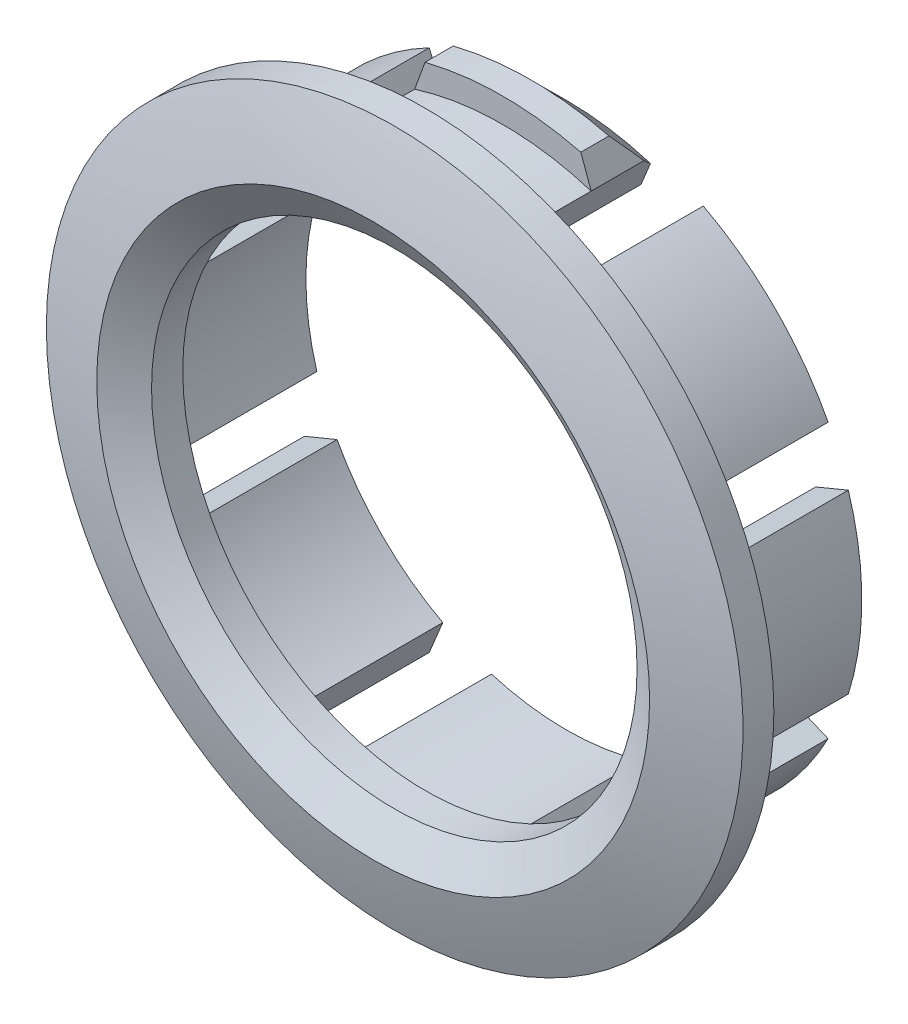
ISO-10303-21;
HEADER;
FILE_DESCRIPTION(('STEP AP214'),'2;1');
FILE_NAME('part.step','',(''),(''),'','','');
FILE_SCHEMA(('AUTOMOTIVE_DESIGN { 1 0 10303 214 1 1 1 1 }'));
ENDSEC;
DATA;
#1=APPLICATION_CONTEXT('core data for automotive mechanical design processes');
#2=APPLICATION_PROTOCOL_DEFINITION('international standard','automotive_design',2000,#1);
#3=PRODUCT_CONTEXT('',#1,'mechanical');
#4=PRODUCT('Part','Part','',(#3));
#5=PRODUCT_RELATED_PRODUCT_CATEGORY('part','',(#4));
#6=PRODUCT_DEFINITION_FORMATION('','',#4);
#7=PRODUCT_DEFINITION_CONTEXT('part definition',#1,'design');
#8=PRODUCT_DEFINITION('design','',#6,#7);
#9=PRODUCT_DEFINITION_SHAPE('','',#8);
#10=(LENGTH_UNIT() NAMED_UNIT(*) SI_UNIT(.MILLI.,.METRE.));
#11=(NAMED_UNIT(*) PLANE_ANGLE_UNIT() SI_UNIT($,.RADIAN.));
#12=(NAMED_UNIT(*) SI_UNIT($,.STERADIAN.) SOLID_ANGLE_UNIT());
#13=UNCERTAINTY_MEASURE_WITH_UNIT(LENGTH_MEASURE(1.E-05),#10,'distance_accuracy_value','');
#14=(GEOMETRIC_REPRESENTATION_CONTEXT(3) GLOBAL_UNCERTAINTY_ASSIGNED_CONTEXT((#13)) GLOBAL_UNIT_ASSIGNED_CONTEXT((#10,
#11,#12)) REPRESENTATION_CONTEXT('',''));
#15=CARTESIAN_POINT('',(0.,0.,0.));
#16=DIRECTION('',(0.,0.,1.));
#17=DIRECTION('',(1.,0.,0.));
#18=AXIS2_PLACEMENT_3D('',#15,#16,#17);
#19=CARTESIAN_POINT('',(0.,0.,-29.258787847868));
#20=DIRECTION('',(0.,0.,1.));
#21=DIRECTION('',(1.,0.,0.));
#22=AXIS2_PLACEMENT_3D('',#19,#20,#21);
#23=CYLINDRICAL_SURFACE('',#22,8.4);
#24=CARTESIAN_POINT('',(0.,0.,-2.2));
#25=DIRECTION('',(0.,0.,-1.));
#26=DIRECTION('',(-1.,0.,0.));
#27=AXIS2_PLACEMENT_3D('',#24,#25,#26);
#28=CIRCLE('',#27,8.4);
#29=CARTESIAN_POINT('',(-2.50879248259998,-8.0166052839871,-2.2));
#30=VERTEX_POINT('',#29);
#31=CARTESIAN_POINT('',(2.50879248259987,-8.01660528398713,-2.2));
#32=VERTEX_POINT('',#31);
#33=EDGE_CURVE('E348',#30,#32,#28,.F.);
#34=ORIENTED_EDGE('',*,*,#33,.T.);
#35=DIRECTION('',(0.,0.,-1.));
#36=VECTOR('',#35,1.);
#37=CARTESIAN_POINT('',(2.50879248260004,-8.01660528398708,2.7784146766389));
#38=LINE('',#37,#36);
#39=CARTESIAN_POINT('',(2.50879248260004,-8.01660528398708,0.));
#40=VERTEX_POINT('',#39);
#41=EDGE_CURVE('E412',#40,#32,#38,.T.);
#42=ORIENTED_EDGE('',*,*,#41,.F.);
#43=CARTESIAN_POINT('',(0.,0.,0.));
#44=DIRECTION('',(0.,0.,1.));
#45=DIRECTION('',(1.,0.,0.));
#46=AXIS2_PLACEMENT_3D('',#43,#44,#45);
#47=CIRCLE('',#46,8.4);
#48=CARTESIAN_POINT('',(-2.50879248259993,-8.01660528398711,0.));
#49=VERTEX_POINT('',#48);
#50=EDGE_CURVE('E867',#40,#49,#47,.F.);
#51=ORIENTED_EDGE('',*,*,#50,.T.);
#52=DIRECTION('',(0.,0.,-1.));
#53=VECTOR('',#52,1.);
#54=CARTESIAN_POINT('',(-2.50879248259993,-8.01660528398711,2.77841467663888));
#55=LINE('',#54,#53);
#56=EDGE_CURVE('E425',#49,#30,#55,.T.);
#57=ORIENTED_EDGE('',*,*,#56,.T.);
#58=EDGE_LOOP('',(#34,#42,#51,#57));
#59=FACE_BOUND('',#58,.T.);
#60=ADVANCED_FACE('F36',(#59),#23,.T.);
#61=CARTESIAN_POINT('',(0.,0.,-2.2));
#62=DIRECTION('',(0.,0.,-1.));
#63=DIRECTION('',(-1.,0.,0.));
#64=AXIS2_PLACEMENT_3D('',#61,#62,#63);
#65=CIRCLE('',#64,8.4);
#66=CARTESIAN_POINT('',(-2.50879248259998,8.0166052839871,-2.2));
#67=VERTEX_POINT('',#66);
#68=CARTESIAN_POINT('',(2.50879248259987,8.01660528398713,-2.2));
#69=VERTEX_POINT('',#68);
#70=EDGE_CURVE('E333',#67,#69,#65,.T.);
#71=ORIENTED_EDGE('',*,*,#70,.F.);
#72=DIRECTION('',(0.,0.,-1.));
#73=VECTOR('',#72,1.);
#74=CARTESIAN_POINT('',(-2.50879248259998,8.0166052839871,2.77841467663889));
#75=LINE('',#74,#73);
#76=CARTESIAN_POINT('',(-2.50879248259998,8.0166052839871,0.));
#77=VERTEX_POINT('',#76);
#78=EDGE_CURVE('E476',#77,#67,#75,.T.);
#79=ORIENTED_EDGE('',*,*,#78,.F.);
#80=CARTESIAN_POINT('',(2.50879248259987,8.01660528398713,0.));
#81=VERTEX_POINT('',#80);
#82=EDGE_CURVE('E501',#77,#81,#47,.F.);
#83=ORIENTED_EDGE('',*,*,#82,.T.);
#84=DIRECTION('',(0.,0.,-1.));
#85=VECTOR('',#84,1.);
#86=CARTESIAN_POINT('',(2.50879248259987,8.01660528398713,2.77841467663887));
#87=LINE('',#86,#85);
#88=EDGE_CURVE('E361',#81,#69,#87,.T.);
#89=ORIENTED_EDGE('',*,*,#88,.T.);
#90=EDGE_LOOP('',(#71,#79,#83,#89));
#91=FACE_BOUND('',#90,.T.);
#92=ADVANCED_FACE('F661',(#91),#23,.T.);
#93=CARTESIAN_POINT('',(0.,0.,-4.));
#94=DIRECTION('',(0.,0.,-1.));
#95=DIRECTION('',(-1.,0.,0.));
#96=AXIS2_PLACEMENT_3D('',#93,#94,#95);
#97=CIRCLE('',#96,8.4);
#98=CARTESIAN_POINT('',(3.89461178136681,7.44258013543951,-4.));
#99=VERTEX_POINT('',#98);
#100=CARTESIAN_POINT('',(7.44258013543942,3.89461178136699,-4.));
#101=VERTEX_POINT('',#100);
#102=EDGE_CURVE('E490',#99,#101,#97,.T.);
#103=ORIENTED_EDGE('',*,*,#102,.F.);
#104=DIRECTION('',(0.,0.,-1.));
#105=VECTOR('',#104,1.);
#106=CARTESIAN_POINT('',(3.89461178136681,7.44258013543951,2.77841467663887));
#107=LINE('',#106,#105);
#108=CARTESIAN_POINT('',(3.89461178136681,7.44258013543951,0.));
#109=VERTEX_POINT('',#108);
#110=EDGE_CURVE('E364',#109,#99,#107,.T.);
#111=ORIENTED_EDGE('',*,*,#110,.F.);
#112=CARTESIAN_POINT('',(7.44258013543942,3.89461178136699,0.));
#113=VERTEX_POINT('',#112);
#114=EDGE_CURVE('E505',#109,#113,#47,.F.);
#115=ORIENTED_EDGE('',*,*,#114,.T.);
#116=DIRECTION('',(0.,0.,-1.));
#117=VECTOR('',#116,1.);
#118=CARTESIAN_POINT('',(7.44258013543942,3.89461178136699,2.7784146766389));
#119=LINE('',#118,#117);
#120=EDGE_CURVE('E377',#113,#101,#119,.T.);
#121=ORIENTED_EDGE('',*,*,#120,.T.);
#122=EDGE_LOOP('',(#103,#111,#115,#121));
#123=FACE_BOUND('',#122,.T.);
#124=ADVANCED_FACE('F664',(#123),#23,.T.);
#125=CARTESIAN_POINT('',(0.,0.,-4.));
#126=DIRECTION('',(0.,0.,-1.));
#127=DIRECTION('',(0.,1.,0.));
#128=AXIS2_PLACEMENT_3D('',#125,#126,#127);
#129=PLANE('',#128);
#130=DIRECTION('',(-0.382683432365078,-0.923879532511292,0.));
#131=VECTOR('',#130,1.);
#132=CARTESIAN_POINT('',(3.31778047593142,6.04998617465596,-4.));
#133=LINE('',#132,#131);
#134=CARTESIAN_POINT('',(3.51018494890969,6.51449166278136,-4.));
#135=VERTEX_POINT('',#134);
#136=EDGE_CURVE('E351',#99,#135,#133,.T.);
#137=ORIENTED_EDGE('',*,*,#136,.F.);
#138=ORIENTED_EDGE('',*,*,#102,.T.);
#139=DIRECTION('',(0.923879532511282,0.3826834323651,0.));
#140=VECTOR('',#139,1.);
#141=CARTESIAN_POINT('',(6.04998617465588,3.31778047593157,-4.));
#142=LINE('',#141,#140);
#143=CARTESIAN_POINT('',(6.51449166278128,3.51018494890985,-4.));
#144=VERTEX_POINT('',#143);
#145=EDGE_CURVE('E367',#144,#101,#142,.T.);
#146=ORIENTED_EDGE('',*,*,#145,.F.);
#147=CARTESIAN_POINT('',(0.,0.,-4.));
#148=DIRECTION('',(0.,0.,-1.));
#149=DIRECTION('',(-1.,0.,0.));
#150=AXIS2_PLACEMENT_3D('',#147,#148,#149);
#151=CIRCLE('',#150,7.4);
#152=EDGE_CURVE('E484',#135,#144,#151,.T.);
#153=ORIENTED_EDGE('',*,*,#152,.F.);
#154=EDGE_LOOP('',(#137,#138,#146,#153));
#155=FACE_BOUND('',#154,.T.);
#156=ADVANCED_FACE('F673',(#155),#129,.T.);
#157=CARTESIAN_POINT('',(0.,0.,20.9303607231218));
#158=DIRECTION('',(0.,0.,-1.));
#159=DIRECTION('',(-1.,0.,0.));
#160=AXIS2_PLACEMENT_3D('',#157,#158,#159);
#161=CYLINDRICAL_SURFACE('',#160,7.4);
#162=CARTESIAN_POINT('',(0.,0.,0.));
#163=DIRECTION('',(0.,0.,1.));
#164=DIRECTION('',(1.,0.,0.));
#165=AXIS2_PLACEMENT_3D('',#162,#163,#164);
#166=CIRCLE('',#165,7.4);
#167=CARTESIAN_POINT('',(3.51018494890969,6.51449166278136,0.));
#168=VERTEX_POINT('',#167);
#169=CARTESIAN_POINT('',(6.51449166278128,3.51018494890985,0.));
#170=VERTEX_POINT('',#169);
#171=EDGE_CURVE('E489',#168,#170,#166,.F.);
#172=ORIENTED_EDGE('',*,*,#171,.F.);
#173=DIRECTION('',(0.,0.,-1.));
#174=VECTOR('',#173,1.);
#175=CARTESIAN_POINT('',(3.51018494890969,6.51449166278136,20.9303607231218));
#176=LINE('',#175,#174);
#177=EDGE_CURVE('E558',#168,#135,#176,.T.);
#178=ORIENTED_EDGE('',*,*,#177,.T.);
#179=ORIENTED_EDGE('',*,*,#152,.T.);
#180=DIRECTION('',(0.,0.,-1.));
#181=VECTOR('',#180,1.);
#182=CARTESIAN_POINT('',(6.51449166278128,3.51018494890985,20.9303607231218));
#183=LINE('',#182,#181);
#184=EDGE_CURVE('E549',#144,#170,#183,.F.);
#185=ORIENTED_EDGE('',*,*,#184,.T.);
#186=EDGE_LOOP('',(#172,#178,#179,#185));
#187=FACE_BOUND('',#186,.T.);
#188=ADVANCED_FACE('F679',(#187),#161,.F.);
#189=CARTESIAN_POINT('',(8.01660528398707,2.50879248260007,-4.));
#190=VERTEX_POINT('',#189);
#191=CARTESIAN_POINT('',(8.01660528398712,-2.5087924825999,-4.));
#192=VERTEX_POINT('',#191);
#193=EDGE_CURVE('E493',#190,#192,#97,.T.);
#194=ORIENTED_EDGE('',*,*,#193,.F.);
#195=DIRECTION('',(0.,0.,-1.));
#196=VECTOR('',#195,1.);
#197=CARTESIAN_POINT('',(8.01660528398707,2.50879248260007,2.7784146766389));
#198=LINE('',#197,#196);
#199=CARTESIAN_POINT('',(8.01660528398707,2.50879248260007,0.));
#200=VERTEX_POINT('',#199);
#201=EDGE_CURVE('E380',#200,#190,#198,.T.);
#202=ORIENTED_EDGE('',*,*,#201,.F.);
#203=CARTESIAN_POINT('',(8.01660528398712,-2.5087924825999,0.));
#204=VERTEX_POINT('',#203);
#205=EDGE_CURVE('E767',#200,#204,#47,.F.);
#206=ORIENTED_EDGE('',*,*,#205,.T.);
#207=DIRECTION('',(0.,0.,-1.));
#208=VECTOR('',#207,1.);
#209=CARTESIAN_POINT('',(8.01660528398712,-2.5087924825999,2.77841467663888));
#210=LINE('',#209,#208);
#211=EDGE_CURVE('E393',#204,#192,#210,.T.);
#212=ORIENTED_EDGE('',*,*,#211,.T.);
#213=EDGE_LOOP('',(#194,#202,#206,#212));
#214=FACE_BOUND('',#213,.T.);
#215=ADVANCED_FACE('F675',(#214),#23,.T.);
#216=DIRECTION('',(-0.923879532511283,-0.3826834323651,0.));
#217=VECTOR('',#216,1.);
#218=CARTESIAN_POINT('',(6.62401132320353,1.93196117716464,-4.));
#219=LINE('',#218,#217);
#220=CARTESIAN_POINT('',(7.08851681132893,2.12436565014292,-4.));
#221=VERTEX_POINT('',#220);
#222=EDGE_CURVE('E366',#190,#221,#219,.T.);
#223=ORIENTED_EDGE('',*,*,#222,.F.);
#224=ORIENTED_EDGE('',*,*,#193,.T.);
#225=DIRECTION('',(0.92387953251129,-0.382683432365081,0.));
#226=VECTOR('',#225,1.);
#227=CARTESIAN_POINT('',(6.62401132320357,-1.9319611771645,-4.));
#228=LINE('',#227,#226);
#229=CARTESIAN_POINT('',(7.08851681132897,-2.12436565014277,-4.));
#230=VERTEX_POINT('',#229);
#231=EDGE_CURVE('E383',#230,#192,#228,.T.);
#232=ORIENTED_EDGE('',*,*,#231,.F.);
#233=EDGE_CURVE('E774',#221,#230,#151,.T.);
#234=ORIENTED_EDGE('',*,*,#233,.F.);
#235=EDGE_LOOP('',(#223,#224,#232,#234));
#236=FACE_BOUND('',#235,.T.);
#237=ADVANCED_FACE('F681',(#236),#129,.T.);
#238=CARTESIAN_POINT('',(7.08851681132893,2.12436565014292,0.));
#239=VERTEX_POINT('',#238);
#240=CARTESIAN_POINT('',(7.08851681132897,-2.12436565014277,0.));
#241=VERTEX_POINT('',#240);
#242=EDGE_CURVE('E773',#239,#241,#166,.F.);
#243=ORIENTED_EDGE('',*,*,#242,.F.);
#244=DIRECTION('',(0.,0.,-1.));
#245=VECTOR('',#244,1.);
#246=CARTESIAN_POINT('',(7.08851681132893,2.12436565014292,20.9303607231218));
#247=LINE('',#246,#245);
#248=EDGE_CURVE('E552',#239,#221,#247,.T.);
#249=ORIENTED_EDGE('',*,*,#248,.T.);
#250=ORIENTED_EDGE('',*,*,#233,.T.);
#251=DIRECTION('',(0.,0.,-1.));
#252=VECTOR('',#251,1.);
#253=CARTESIAN_POINT('',(7.08851681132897,-2.12436565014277,20.9303607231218));
#254=LINE('',#253,#252);
#255=EDGE_CURVE('E543',#230,#241,#254,.F.);
#256=ORIENTED_EDGE('',*,*,#255,.T.);
#257=EDGE_LOOP('',(#243,#249,#250,#256));
#258=FACE_BOUND('',#257,.T.);
#259=ADVANCED_FACE('F691',(#258),#161,.F.);
#260=CARTESIAN_POINT('',(7.4425801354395,-3.89461178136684,-4.));
#261=VERTEX_POINT('',#260);
#262=CARTESIAN_POINT('',(3.89461178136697,-7.44258013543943,-4.));
#263=VERTEX_POINT('',#262);
#264=EDGE_CURVE('E754',#261,#263,#97,.T.);
#265=ORIENTED_EDGE('',*,*,#264,.F.);
#266=DIRECTION('',(0.,0.,-1.));
#267=VECTOR('',#266,1.);
#268=CARTESIAN_POINT('',(7.4425801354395,-3.89461178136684,2.77841467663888));
#269=LINE('',#268,#267);
#270=CARTESIAN_POINT('',(7.4425801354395,-3.89461178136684,0.));
#271=VERTEX_POINT('',#270);
#272=EDGE_CURVE('E396',#271,#261,#269,.T.);
#273=ORIENTED_EDGE('',*,*,#272,.F.);
#274=CARTESIAN_POINT('',(3.89461178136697,-7.44258013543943,0.));
#275=VERTEX_POINT('',#274);
#276=EDGE_CURVE('E769',#271,#275,#47,.F.);
#277=ORIENTED_EDGE('',*,*,#276,.T.);
#278=DIRECTION('',(0.,0.,-1.));
#279=VECTOR('',#278,1.);
#280=CARTESIAN_POINT('',(3.89461178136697,-7.44258013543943,2.7784146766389));
#281=LINE('',#280,#279);
#282=EDGE_CURVE('E409',#275,#263,#281,.T.);
#283=ORIENTED_EDGE('',*,*,#282,.T.);
#284=EDGE_LOOP('',(#265,#273,#277,#283));
#285=FACE_BOUND('',#284,.T.);
#286=ADVANCED_FACE('F686',(#285),#23,.T.);
#287=DIRECTION('',(-0.92387953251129,0.382683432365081,0.));
#288=VECTOR('',#287,1.);
#289=CARTESIAN_POINT('',(6.04998617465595,-3.31778047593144,-4.));
#290=LINE('',#289,#288);
#291=CARTESIAN_POINT('',(6.51449166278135,-3.51018494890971,-4.));
#292=VERTEX_POINT('',#291);
#293=EDGE_CURVE('E382',#261,#292,#290,.T.);
#294=ORIENTED_EDGE('',*,*,#293,.F.);
#295=ORIENTED_EDGE('',*,*,#264,.T.);
#296=DIRECTION('',(0.382683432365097,-0.923879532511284,0.));
#297=VECTOR('',#296,1.);
#298=CARTESIAN_POINT('',(3.31778047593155,-6.04998617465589,-4.));
#299=LINE('',#298,#297);
#300=CARTESIAN_POINT('',(3.51018494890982,-6.51449166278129,-4.));
#301=VERTEX_POINT('',#300);
#302=EDGE_CURVE('E399',#301,#263,#299,.T.);
#303=ORIENTED_EDGE('',*,*,#302,.F.);
#304=EDGE_CURVE('E775',#292,#301,#151,.T.);
#305=ORIENTED_EDGE('',*,*,#304,.F.);
#306=EDGE_LOOP('',(#294,#295,#303,#305));
#307=FACE_BOUND('',#306,.T.);
#308=ADVANCED_FACE('F693',(#307),#129,.T.);
#309=CARTESIAN_POINT('',(6.51449166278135,-3.51018494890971,0.));
#310=VERTEX_POINT('',#309);
#311=CARTESIAN_POINT('',(3.51018494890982,-6.51449166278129,0.));
#312=VERTEX_POINT('',#311);
#313=EDGE_CURVE('E808',#310,#312,#166,.F.);
#314=ORIENTED_EDGE('',*,*,#313,.F.);
#315=DIRECTION('',(0.,0.,-1.));
#316=VECTOR('',#315,1.);
#317=CARTESIAN_POINT('',(6.51449166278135,-3.51018494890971,20.9303607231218));
#318=LINE('',#317,#316);
#319=EDGE_CURVE('E546',#310,#292,#318,.T.);
#320=ORIENTED_EDGE('',*,*,#319,.T.);
#321=ORIENTED_EDGE('',*,*,#304,.T.);
#322=DIRECTION('',(0.,0.,-1.));
#323=VECTOR('',#322,1.);
#324=CARTESIAN_POINT('',(3.51018494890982,-6.51449166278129,20.9303607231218));
#325=LINE('',#324,#323);
#326=EDGE_CURVE('E537',#301,#312,#325,.F.);
#327=ORIENTED_EDGE('',*,*,#326,.T.);
#328=EDGE_LOOP('',(#314,#320,#321,#327));
#329=FACE_BOUND('',#328,.T.);
#330=ADVANCED_FACE('F705',(#329),#161,.F.);
#331=DIRECTION('',(-0.382683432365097,0.923879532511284,0.));
#332=VECTOR('',#331,1.);
#333=CARTESIAN_POINT('',(1.93196117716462,-6.62401132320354,-4.));
#334=LINE('',#333,#332);
#335=CARTESIAN_POINT('',(2.39350993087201,-7.73828858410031,-4.));
#336=VERTEX_POINT('',#335);
#337=CARTESIAN_POINT('',(2.1243656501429,-7.08851681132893,-4.));
#338=VERTEX_POINT('',#337);
#339=EDGE_CURVE('E398',#336,#338,#334,.T.);
#340=ORIENTED_EDGE('',*,*,#339,.F.);
#341=CARTESIAN_POINT('',(0.,0.,-4.));
#342=DIRECTION('',(0.,0.,-1.));
#343=DIRECTION('',(-1.,0.,0.));
#344=AXIS2_PLACEMENT_3D('',#341,#342,#343);
#345=CIRCLE('',#344,8.10000000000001);
#346=CARTESIAN_POINT('',(-2.39350993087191,-7.73828858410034,-4.));
#347=VERTEX_POINT('',#346);
#348=EDGE_CURVE('E63',#336,#347,#345,.T.);
#349=ORIENTED_EDGE('',*,*,#348,.T.);
#350=DIRECTION('',(-0.382683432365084,-0.923879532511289,0.));
#351=VECTOR('',#350,1.);
#352=CARTESIAN_POINT('',(-1.93196117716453,-6.62401132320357,-4.));
#353=LINE('',#352,#351);
#354=CARTESIAN_POINT('',(-2.1243656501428,-7.08851681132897,-4.));
#355=VERTEX_POINT('',#354);
#356=EDGE_CURVE('E416',#355,#347,#353,.T.);
#357=ORIENTED_EDGE('',*,*,#356,.F.);
#358=EDGE_CURVE('E776',#338,#355,#151,.T.);
#359=ORIENTED_EDGE('',*,*,#358,.F.);
#360=EDGE_LOOP('',(#340,#349,#357,#359));
#361=FACE_BOUND('',#360,.T.);
#362=ADVANCED_FACE('F707',(#361),#129,.T.);
#363=CARTESIAN_POINT('',(2.1243656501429,-7.08851681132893,0.));
#364=VERTEX_POINT('',#363);
#365=CARTESIAN_POINT('',(-2.1243656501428,-7.08851681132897,0.));
#366=VERTEX_POINT('',#365);
#367=EDGE_CURVE('E804',#364,#366,#166,.F.);
#368=ORIENTED_EDGE('',*,*,#367,.F.);
#369=DIRECTION('',(0.,0.,-1.));
#370=VECTOR('',#369,1.);
#371=CARTESIAN_POINT('',(2.1243656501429,-7.08851681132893,20.9303607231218));
#372=LINE('',#371,#370);
#373=EDGE_CURVE('E540',#364,#338,#372,.T.);
#374=ORIENTED_EDGE('',*,*,#373,.T.);
#375=ORIENTED_EDGE('',*,*,#358,.T.);
#376=DIRECTION('',(0.,0.,-1.));
#377=VECTOR('',#376,1.);
#378=CARTESIAN_POINT('',(-2.1243656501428,-7.08851681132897,20.9303607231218));
#379=LINE('',#378,#377);
#380=EDGE_CURVE('E531',#355,#366,#379,.F.);
#381=ORIENTED_EDGE('',*,*,#380,.T.);
#382=EDGE_LOOP('',(#368,#374,#375,#381));
#383=FACE_BOUND('',#382,.T.);
#384=ADVANCED_FACE('F712',(#383),#161,.F.);
#385=CARTESIAN_POINT('',(-3.89461178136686,-7.44258013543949,-4.));
#386=VERTEX_POINT('',#385);
#387=CARTESIAN_POINT('',(-7.44258013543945,-3.89461178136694,-4.));
#388=VERTEX_POINT('',#387);
#389=EDGE_CURVE('E751',#386,#388,#97,.T.);
#390=ORIENTED_EDGE('',*,*,#389,.F.);
#391=DIRECTION('',(0.,0.,-1.));
#392=VECTOR('',#391,1.);
#393=CARTESIAN_POINT('',(-3.89461178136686,-7.44258013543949,2.77841467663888));
#394=LINE('',#393,#392);
#395=CARTESIAN_POINT('',(-3.89461178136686,-7.44258013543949,0.));
#396=VERTEX_POINT('',#395);
#397=EDGE_CURVE('E428',#396,#386,#394,.T.);
#398=ORIENTED_EDGE('',*,*,#397,.F.);
#399=CARTESIAN_POINT('',(-7.44258013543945,-3.89461178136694,0.));
#400=VERTEX_POINT('',#399);
#401=EDGE_CURVE('E868',#396,#400,#47,.F.);
#402=ORIENTED_EDGE('',*,*,#401,.T.);
#403=DIRECTION('',(0.,0.,-1.));
#404=VECTOR('',#403,1.);
#405=CARTESIAN_POINT('',(-7.44258013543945,-3.89461178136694,2.77841467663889));
#406=LINE('',#405,#404);
#407=EDGE_CURVE('E441',#400,#388,#406,.T.);
#408=ORIENTED_EDGE('',*,*,#407,.T.);
#409=EDGE_LOOP('',(#390,#398,#402,#408));
#410=FACE_BOUND('',#409,.T.);
#411=ADVANCED_FACE('F700',(#410),#23,.T.);
#412=DIRECTION('',(0.382683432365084,0.923879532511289,0.));
#413=VECTOR('',#412,1.);
#414=CARTESIAN_POINT('',(-3.31778047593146,-6.04998617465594,-4.));
#415=LINE('',#414,#413);
#416=CARTESIAN_POINT('',(-3.51018494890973,-6.51449166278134,-4.));
#417=VERTEX_POINT('',#416);
#418=EDGE_CURVE('E415',#386,#417,#415,.T.);
#419=ORIENTED_EDGE('',*,*,#418,.F.);
#420=ORIENTED_EDGE('',*,*,#389,.T.);
#421=DIRECTION('',(-0.923879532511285,-0.382683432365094,0.));
#422=VECTOR('',#421,1.);
#423=CARTESIAN_POINT('',(-6.0499861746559,-3.31778047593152,-4.));
#424=LINE('',#423,#422);
#425=CARTESIAN_POINT('',(-6.5144916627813,-3.5101849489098,-4.));
#426=VERTEX_POINT('',#425);
#427=EDGE_CURVE('E431',#426,#388,#424,.T.);
#428=ORIENTED_EDGE('',*,*,#427,.F.);
#429=EDGE_CURVE('E780',#417,#426,#151,.T.);
#430=ORIENTED_EDGE('',*,*,#429,.F.);
#431=EDGE_LOOP('',(#419,#420,#428,#430));
#432=FACE_BOUND('',#431,.T.);
#433=ADVANCED_FACE('F711',(#432),#129,.T.);
#434=CARTESIAN_POINT('',(-3.51018494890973,-6.51449166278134,0.));
#435=VERTEX_POINT('',#434);
#436=CARTESIAN_POINT('',(-6.5144916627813,-3.5101849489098,0.));
#437=VERTEX_POINT('',#436);
#438=EDGE_CURVE('E800',#435,#437,#166,.F.);
#439=ORIENTED_EDGE('',*,*,#438,.F.);
#440=DIRECTION('',(0.,0.,-1.));
#441=VECTOR('',#440,1.);
#442=CARTESIAN_POINT('',(-3.51018494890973,-6.51449166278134,20.9303607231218));
#443=LINE('',#442,#441);
#444=EDGE_CURVE('E534',#435,#417,#443,.T.);
#445=ORIENTED_EDGE('',*,*,#444,.T.);
#446=ORIENTED_EDGE('',*,*,#429,.T.);
#447=DIRECTION('',(0.,0.,-1.));
#448=VECTOR('',#447,1.);
#449=CARTESIAN_POINT('',(-6.5144916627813,-3.5101849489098,20.9303607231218));
#450=LINE('',#449,#448);
#451=EDGE_CURVE('E525',#426,#437,#450,.F.);
#452=ORIENTED_EDGE('',*,*,#451,.T.);
#453=EDGE_LOOP('',(#439,#445,#446,#452));
#454=FACE_BOUND('',#453,.T.);
#455=ADVANCED_FACE('F719',(#454),#161,.F.);
#456=CARTESIAN_POINT('',(-8.01660528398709,-2.50879248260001,-4.));
#457=VERTEX_POINT('',#456);
#458=CARTESIAN_POINT('',(-8.01660528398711,2.50879248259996,-4.));
#459=VERTEX_POINT('',#458);
#460=EDGE_CURVE('E750',#457,#459,#97,.T.);
#461=ORIENTED_EDGE('',*,*,#460,.F.);
#462=DIRECTION('',(0.,0.,-1.));
#463=VECTOR('',#462,1.);
#464=CARTESIAN_POINT('',(-8.01660528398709,-2.50879248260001,2.77841467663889));
#465=LINE('',#464,#463);
#466=CARTESIAN_POINT('',(-8.01660528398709,-2.50879248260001,0.));
#467=VERTEX_POINT('',#466);
#468=EDGE_CURVE('E444',#467,#457,#465,.T.);
#469=ORIENTED_EDGE('',*,*,#468,.F.);
#470=CARTESIAN_POINT('',(-8.01660528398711,2.50879248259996,0.));
#471=VERTEX_POINT('',#470);
#472=EDGE_CURVE('E1276',#467,#471,#47,.F.);
#473=ORIENTED_EDGE('',*,*,#472,.T.);
#474=DIRECTION('',(0.,0.,-1.));
#475=VECTOR('',#474,1.);
#476=CARTESIAN_POINT('',(-8.01660528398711,2.50879248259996,2.77841467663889));
#477=LINE('',#476,#475);
#478=EDGE_CURVE('E457',#471,#459,#477,.T.);
#479=ORIENTED_EDGE('',*,*,#478,.T.);
#480=EDGE_LOOP('',(#461,#469,#473,#479));
#481=FACE_BOUND('',#480,.T.);
#482=ADVANCED_FACE('F714',(#481),#23,.T.);
#483=DIRECTION('',(0.923879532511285,0.382683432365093,0.));
#484=VECTOR('',#483,1.);
#485=CARTESIAN_POINT('',(-6.62401132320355,-1.9319611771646,-4.));
#486=LINE('',#485,#484);
#487=CARTESIAN_POINT('',(-7.08851681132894,-2.12436565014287,-4.));
#488=VERTEX_POINT('',#487);
#489=EDGE_CURVE('E430',#457,#488,#486,.T.);
#490=ORIENTED_EDGE('',*,*,#489,.F.);
#491=ORIENTED_EDGE('',*,*,#460,.T.);
#492=DIRECTION('',(-0.923879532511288,0.382683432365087,0.));
#493=VECTOR('',#492,1.);
#494=CARTESIAN_POINT('',(-6.62401132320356,1.93196117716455,-4.));
#495=LINE('',#494,#493);
#496=CARTESIAN_POINT('',(-7.08851681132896,2.12436565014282,-4.));
#497=VERTEX_POINT('',#496);
#498=EDGE_CURVE('E447',#497,#459,#495,.T.);
#499=ORIENTED_EDGE('',*,*,#498,.F.);
#500=EDGE_CURVE('E783',#488,#497,#151,.T.);
#501=ORIENTED_EDGE('',*,*,#500,.F.);
#502=EDGE_LOOP('',(#490,#491,#499,#501));
#503=FACE_BOUND('',#502,.T.);
#504=ADVANCED_FACE('F721',(#503),#129,.T.);
#505=CARTESIAN_POINT('',(-7.08851681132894,-2.12436565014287,0.));
#506=VERTEX_POINT('',#505);
#507=CARTESIAN_POINT('',(-7.08851681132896,2.12436565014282,0.));
#508=VERTEX_POINT('',#507);
#509=EDGE_CURVE('E799',#506,#508,#166,.F.);
#510=ORIENTED_EDGE('',*,*,#509,.F.);
#511=DIRECTION('',(0.,0.,-1.));
#512=VECTOR('',#511,1.);
#513=CARTESIAN_POINT('',(-7.08851681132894,-2.12436565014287,20.9303607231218));
#514=LINE('',#513,#512);
#515=EDGE_CURVE('E528',#506,#488,#514,.T.);
#516=ORIENTED_EDGE('',*,*,#515,.T.);
#517=ORIENTED_EDGE('',*,*,#500,.T.);
#518=DIRECTION('',(0.,0.,-1.));
#519=VECTOR('',#518,1.);
#520=CARTESIAN_POINT('',(-7.08851681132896,2.12436565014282,20.9303607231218));
#521=LINE('',#520,#519);
#522=EDGE_CURVE('E519',#497,#508,#521,.F.);
#523=ORIENTED_EDGE('',*,*,#522,.T.);
#524=EDGE_LOOP('',(#510,#516,#517,#523));
#525=FACE_BOUND('',#524,.T.);
#526=ADVANCED_FACE('F730',(#525),#161,.F.);
#527=CARTESIAN_POINT('',(-7.44258013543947,3.89461178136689,-4.));
#528=VERTEX_POINT('',#527);
#529=CARTESIAN_POINT('',(-3.89461178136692,7.44258013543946,-4.));
#530=VERTEX_POINT('',#529);
#531=EDGE_CURVE('E494',#528,#530,#97,.T.);
#532=ORIENTED_EDGE('',*,*,#531,.F.);
#533=DIRECTION('',(0.,0.,-1.));
#534=VECTOR('',#533,1.);
#535=CARTESIAN_POINT('',(-7.44258013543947,3.89461178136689,2.77841467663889));
#536=LINE('',#535,#534);
#537=CARTESIAN_POINT('',(-7.44258013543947,3.89461178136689,0.));
#538=VERTEX_POINT('',#537);
#539=EDGE_CURVE('E460',#538,#528,#536,.T.);
#540=ORIENTED_EDGE('',*,*,#539,.F.);
#541=CARTESIAN_POINT('',(-3.89461178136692,7.44258013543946,0.));
#542=VERTEX_POINT('',#541);
#543=EDGE_CURVE('E500',#538,#542,#47,.F.);
#544=ORIENTED_EDGE('',*,*,#543,.T.);
#545=DIRECTION('',(0.,0.,-1.));
#546=VECTOR('',#545,1.);
#547=CARTESIAN_POINT('',(-3.89461178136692,7.44258013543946,2.77841467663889));
#548=LINE('',#547,#546);
#549=EDGE_CURVE('E473',#542,#530,#548,.T.);
#550=ORIENTED_EDGE('',*,*,#549,.T.);
#551=EDGE_LOOP('',(#532,#540,#544,#550));
#552=FACE_BOUND('',#551,.T.);
#553=ADVANCED_FACE('F669',(#552),#23,.T.);
#554=DIRECTION('',(0.923879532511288,-0.382683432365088,0.));
#555=VECTOR('',#554,1.);
#556=CARTESIAN_POINT('',(-6.04998617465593,3.31778047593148,-4.));
#557=LINE('',#556,#555);
#558=CARTESIAN_POINT('',(-6.51449166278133,3.51018494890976,-4.));
#559=VERTEX_POINT('',#558);
#560=EDGE_CURVE('E446',#528,#559,#557,.T.);
#561=ORIENTED_EDGE('',*,*,#560,.F.);
#562=ORIENTED_EDGE('',*,*,#531,.T.);
#563=DIRECTION('',(-0.382683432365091,0.923879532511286,0.));
#564=VECTOR('',#563,1.);
#565=CARTESIAN_POINT('',(-3.3177804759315,6.04998617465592,-4.));
#566=LINE('',#565,#564);
#567=CARTESIAN_POINT('',(-3.51018494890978,6.51449166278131,-4.));
#568=VERTEX_POINT('',#567);
#569=EDGE_CURVE('E463',#568,#530,#566,.T.);
#570=ORIENTED_EDGE('',*,*,#569,.F.);
#571=EDGE_CURVE('E479',#559,#568,#151,.T.);
#572=ORIENTED_EDGE('',*,*,#571,.F.);
#573=EDGE_LOOP('',(#561,#562,#570,#572));
#574=FACE_BOUND('',#573,.T.);
#575=ADVANCED_FACE('F732',(#574),#129,.T.);
#576=CARTESIAN_POINT('',(-6.51449166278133,3.51018494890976,0.));
#577=VERTEX_POINT('',#576);
#578=CARTESIAN_POINT('',(-3.51018494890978,6.51449166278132,0.));
#579=VERTEX_POINT('',#578);
#580=EDGE_CURVE('E483',#577,#579,#166,.F.);
#581=ORIENTED_EDGE('',*,*,#580,.F.);
#582=DIRECTION('',(0.,0.,-1.));
#583=VECTOR('',#582,1.);
#584=CARTESIAN_POINT('',(-6.51449166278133,3.51018494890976,20.9303607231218));
#585=LINE('',#584,#583);
#586=EDGE_CURVE('E522',#577,#559,#585,.T.);
#587=ORIENTED_EDGE('',*,*,#586,.T.);
#588=ORIENTED_EDGE('',*,*,#571,.T.);
#589=DIRECTION('',(0.,0.,-1.));
#590=VECTOR('',#589,1.);
#591=CARTESIAN_POINT('',(-3.51018494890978,6.51449166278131,20.9303607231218));
#592=LINE('',#591,#590);
#593=EDGE_CURVE('E511',#568,#579,#592,.F.);
#594=ORIENTED_EDGE('',*,*,#593,.T.);
#595=EDGE_LOOP('',(#581,#587,#588,#594));
#596=FACE_BOUND('',#595,.T.);
#597=ADVANCED_FACE('F741',(#596),#161,.F.);
#598=CARTESIAN_POINT('',(0.,0.,0.));
#599=DIRECTION('',(0.,0.,1.));
#600=DIRECTION('',(1.,0.,0.));
#601=AXIS2_PLACEMENT_3D('',#598,#599,#600);
#602=PLANE('',#601);
#603=DIRECTION('',(-0.382683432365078,-0.923879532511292,0.));
#604=VECTOR('',#603,1.);
#605=CARTESIAN_POINT('',(3.31778047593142,6.04998617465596,0.));
#606=LINE('',#605,#604);
#607=EDGE_CURVE('E355',#109,#168,#606,.T.);
#608=ORIENTED_EDGE('',*,*,#607,.T.);
#609=ORIENTED_EDGE('',*,*,#171,.T.);
#610=DIRECTION('',(0.923879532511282,0.3826834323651,0.));
#611=VECTOR('',#610,1.);
#612=CARTESIAN_POINT('',(6.04998617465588,3.31778047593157,0.));
#613=LINE('',#612,#611);
#614=EDGE_CURVE('E374',#170,#113,#613,.T.);
#615=ORIENTED_EDGE('',*,*,#614,.T.);
#616=ORIENTED_EDGE('',*,*,#114,.F.);
#617=EDGE_LOOP('',(#608,#609,#615,#616));
#618=FACE_BOUND('',#617,.T.);
#619=CARTESIAN_POINT('',(0.,0.,0.));
#620=DIRECTION('',(0.,0.,1.));
#621=DIRECTION('',(1.,0.,0.));
#622=AXIS2_PLACEMENT_3D('',#619,#620,#621);
#623=CIRCLE('',#622,6.9);
#624=CARTESIAN_POINT('',(6.9,0.,0.));
#625=VERTEX_POINT('',#624);
#626=EDGE_CURVE('E488',#625,#625,#623,.F.);
#627=ORIENTED_EDGE('',*,*,#626,.F.);
#628=EDGE_LOOP('',(#627));
#629=FACE_BOUND('',#628,.T.);
#630=DIRECTION('',(-0.923879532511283,-0.3826834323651,0.));
#631=VECTOR('',#630,1.);
#632=CARTESIAN_POINT('',(6.62401132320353,1.93196117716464,0.));
#633=LINE('',#632,#631);
#634=EDGE_CURVE('E370',#200,#239,#633,.T.);
#635=ORIENTED_EDGE('',*,*,#634,.T.);
#636=ORIENTED_EDGE('',*,*,#242,.T.);
#637=DIRECTION('',(0.923879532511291,-0.382683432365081,0.));
#638=VECTOR('',#637,1.);
#639=CARTESIAN_POINT('',(6.62401132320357,-1.9319611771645,0.));
#640=LINE('',#639,#638);
#641=EDGE_CURVE('E390',#241,#204,#640,.T.);
#642=ORIENTED_EDGE('',*,*,#641,.T.);
#643=ORIENTED_EDGE('',*,*,#205,.F.);
#644=EDGE_LOOP('',(#635,#636,#642,#643));
#645=FACE_BOUND('',#644,.T.);
#646=DIRECTION('',(-0.92387953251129,0.382683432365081,0.));
#647=VECTOR('',#646,1.);
#648=CARTESIAN_POINT('',(6.04998617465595,-3.31778047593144,0.));
#649=LINE('',#648,#647);
#650=EDGE_CURVE('E386',#271,#310,#649,.T.);
#651=ORIENTED_EDGE('',*,*,#650,.T.);
#652=ORIENTED_EDGE('',*,*,#313,.T.);
#653=DIRECTION('',(0.382683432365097,-0.923879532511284,0.));
#654=VECTOR('',#653,1.);
#655=CARTESIAN_POINT('',(3.31778047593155,-6.04998617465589,0.));
#656=LINE('',#655,#654);
#657=EDGE_CURVE('E406',#312,#275,#656,.T.);
#658=ORIENTED_EDGE('',*,*,#657,.T.);
#659=ORIENTED_EDGE('',*,*,#276,.F.);
#660=EDGE_LOOP('',(#651,#652,#658,#659));
#661=FACE_BOUND('',#660,.T.);
#662=DIRECTION('',(-0.382683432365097,0.923879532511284,0.));
#663=VECTOR('',#662,1.);
#664=CARTESIAN_POINT('',(1.93196117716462,-6.62401132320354,0.));
#665=LINE('',#664,#663);
#666=EDGE_CURVE('E402',#40,#364,#665,.T.);
#667=ORIENTED_EDGE('',*,*,#666,.T.);
#668=ORIENTED_EDGE('',*,*,#367,.T.);
#669=DIRECTION('',(-0.382683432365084,-0.923879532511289,0.));
#670=VECTOR('',#669,1.);
#671=CARTESIAN_POINT('',(-1.93196117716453,-6.62401132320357,0.));
#672=LINE('',#671,#670);
#673=EDGE_CURVE('E422',#366,#49,#672,.T.);
#674=ORIENTED_EDGE('',*,*,#673,.T.);
#675=ORIENTED_EDGE('',*,*,#50,.F.);
#676=EDGE_LOOP('',(#667,#668,#674,#675));
#677=FACE_BOUND('',#676,.T.);
#678=DIRECTION('',(0.382683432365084,0.923879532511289,0.));
#679=VECTOR('',#678,1.);
#680=CARTESIAN_POINT('',(-3.31778047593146,-6.04998617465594,0.));
#681=LINE('',#680,#679);
#682=EDGE_CURVE('E418',#396,#435,#681,.T.);
#683=ORIENTED_EDGE('',*,*,#682,.T.);
#684=ORIENTED_EDGE('',*,*,#438,.T.);
#685=DIRECTION('',(-0.923879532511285,-0.382683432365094,0.));
#686=VECTOR('',#685,1.);
#687=CARTESIAN_POINT('',(-6.0499861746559,-3.31778047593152,0.));
#688=LINE('',#687,#686);
#689=EDGE_CURVE('E438',#437,#400,#688,.T.);
#690=ORIENTED_EDGE('',*,*,#689,.T.);
#691=ORIENTED_EDGE('',*,*,#401,.F.);
#692=EDGE_LOOP('',(#683,#684,#690,#691));
#693=FACE_BOUND('',#692,.T.);
#694=DIRECTION('',(0.923879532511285,0.382683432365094,0.));
#695=VECTOR('',#694,1.);
#696=CARTESIAN_POINT('',(-6.62401132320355,-1.9319611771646,0.));
#697=LINE('',#696,#695);
#698=EDGE_CURVE('E434',#467,#506,#697,.T.);
#699=ORIENTED_EDGE('',*,*,#698,.T.);
#700=ORIENTED_EDGE('',*,*,#509,.T.);
#701=DIRECTION('',(-0.923879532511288,0.382683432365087,0.));
#702=VECTOR('',#701,1.);
#703=CARTESIAN_POINT('',(-6.62401132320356,1.93196117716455,0.));
#704=LINE('',#703,#702);
#705=EDGE_CURVE('E454',#508,#471,#704,.T.);
#706=ORIENTED_EDGE('',*,*,#705,.T.);
#707=ORIENTED_EDGE('',*,*,#472,.F.);
#708=EDGE_LOOP('',(#699,#700,#706,#707));
#709=FACE_BOUND('',#708,.T.);
#710=DIRECTION('',(0.923879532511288,-0.382683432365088,0.));
#711=VECTOR('',#710,1.);
#712=CARTESIAN_POINT('',(-6.04998617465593,3.31778047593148,0.));
#713=LINE('',#712,#711);
#714=EDGE_CURVE('E450',#538,#577,#713,.T.);
#715=ORIENTED_EDGE('',*,*,#714,.T.);
#716=ORIENTED_EDGE('',*,*,#580,.T.);
#717=DIRECTION('',(-0.382683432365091,0.923879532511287,0.));
#718=VECTOR('',#717,1.);
#719=CARTESIAN_POINT('',(-3.3177804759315,6.04998617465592,0.));
#720=LINE('',#719,#718);
#721=EDGE_CURVE('E470',#579,#542,#720,.T.);
#722=ORIENTED_EDGE('',*,*,#721,.T.);
#723=ORIENTED_EDGE('',*,*,#543,.F.);
#724=EDGE_LOOP('',(#715,#716,#722,#723));
#725=FACE_BOUND('',#724,.T.);
#726=CARTESIAN_POINT('',(0.,0.,0.));
#727=DIRECTION('',(0.,0.,1.));
#728=DIRECTION('',(1.,0.,0.));
#729=AXIS2_PLACEMENT_3D('',#726,#727,#728);
#730=CIRCLE('',#729,9.9);
#731=CARTESIAN_POINT('',(9.9,0.,0.));
#732=VERTEX_POINT('',#731);
#733=EDGE_CURVE('E492',#732,#732,#730,.T.);
#734=ORIENTED_EDGE('',*,*,#733,.F.);
#735=EDGE_LOOP('',(#734));
#736=FACE_BOUND('',#735,.T.);
#737=CARTESIAN_POINT('',(-2.12436565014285,7.08851681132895,0.));
#738=VERTEX_POINT('',#737);
#739=CARTESIAN_POINT('',(2.12436565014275,7.08851681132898,0.));
#740=VERTEX_POINT('',#739);
#741=EDGE_CURVE('E485',#738,#740,#166,.F.);
#742=ORIENTED_EDGE('',*,*,#741,.T.);
#743=DIRECTION('',(0.382683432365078,0.923879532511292,0.));
#744=VECTOR('',#743,1.);
#745=CARTESIAN_POINT('',(1.93196117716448,6.62401132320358,0.));
#746=LINE('',#745,#744);
#747=EDGE_CURVE('E359',#740,#81,#746,.T.);
#748=ORIENTED_EDGE('',*,*,#747,.T.);
#749=ORIENTED_EDGE('',*,*,#82,.F.);
#750=DIRECTION('',(0.38268343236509,-0.923879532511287,0.));
#751=VECTOR('',#750,1.);
#752=CARTESIAN_POINT('',(-1.93196117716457,6.62401132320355,0.));
#753=LINE('',#752,#751);
#754=EDGE_CURVE('E466',#77,#738,#753,.T.);
#755=ORIENTED_EDGE('',*,*,#754,.T.);
#756=EDGE_LOOP('',(#742,#748,#749,#755));
#757=FACE_BOUND('',#756,.T.);
#758=ADVANCED_FACE('F770',(#618,#629,#645,#661,#677,#693,#709,#725,#736,#757),#602,.F.);
#759=CARTESIAN_POINT('',(0.,0.,2.501));
#760=DIRECTION('',(0.,0.,-1.));
#761=DIRECTION('',(-1.,0.,0.));
#762=AXIS2_PLACEMENT_3D('',#759,#760,#761);
#763=CYLINDRICAL_SURFACE('',#762,9.9);
#764=CARTESIAN_POINT('',(0.,0.,0.876691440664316));
#765=DIRECTION('',(0.,0.,-1.));
#766=DIRECTION('',(-1.,0.,0.));
#767=AXIS2_PLACEMENT_3D('',#764,#765,#766);
#768=CIRCLE('',#767,9.9);
#769=CARTESIAN_POINT('',(-9.9,0.,0.876691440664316));
#770=VERTEX_POINT('',#769);
#771=EDGE_CURVE('E497',#770,#770,#768,.T.);
#772=ORIENTED_EDGE('',*,*,#771,.T.);
#773=EDGE_LOOP('',(#772));
#774=FACE_BOUND('',#773,.T.);
#775=ORIENTED_EDGE('',*,*,#733,.T.);
#776=EDGE_LOOP('',(#775));
#777=FACE_BOUND('',#776,.T.);
#778=ADVANCED_FACE('F38',(#774,#777),#763,.T.);
#779=CARTESIAN_POINT('',(0.,0.,-28.5));
#780=DIRECTION('',(-1.,0.,0.));
#781=DIRECTION('',(0.,0.,-1.));
#782=AXIS2_PLACEMENT_3D('',#779,#780,#781);
#783=SPHERICAL_SURFACE('',#782,31.);
#784=CARTESIAN_POINT('',(0.,0.,-28.5));
#785=DIRECTION('',(0.,0.,-1.));
#786=DIRECTION('',(-1.,0.,0.));
#787=AXIS2_PLACEMENT_3D('',#784,#785,#786);
#788=SPHERICAL_SURFACE('',#787,31.);
#789=CARTESIAN_POINT('',(0.,0.,1.48800112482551));
#790=DIRECTION('',(0.,0.,-1.));
#791=DIRECTION('',(-1.,0.,0.));
#792=AXIS2_PLACEMENT_3D('',#789,#790,#791);
#793=CIRCLE('',#792,7.85619427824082);
#794=CARTESIAN_POINT('',(7.85619427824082,0.,1.48800112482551));
#795=VERTEX_POINT('',#794);
#796=EDGE_CURVE('E508',#795,#795,#793,.T.);
#797=ORIENTED_EDGE('',*,*,#796,.T.);
#798=EDGE_LOOP('',(#797));
#799=FACE_BOUND('',#798,.T.);
#800=ORIENTED_EDGE('',*,*,#771,.F.);
#801=EDGE_LOOP('',(#800));
#802=FACE_BOUND('',#801,.T.);
#803=ADVANCED_FACE('F875',(#799,#802),#788,.T.);
#804=DIRECTION('',(0.38268343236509,-0.923879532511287,0.));
#805=VECTOR('',#804,1.);
#806=CARTESIAN_POINT('',(-1.93196117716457,6.62401132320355,-4.));
#807=LINE('',#806,#805);
#808=CARTESIAN_POINT('',(-2.39350993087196,7.73828858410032,-4.));
#809=VERTEX_POINT('',#808);
#810=CARTESIAN_POINT('',(-2.12436565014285,7.08851681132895,-4.));
#811=VERTEX_POINT('',#810);
#812=EDGE_CURVE('E462',#809,#811,#807,.T.);
#813=ORIENTED_EDGE('',*,*,#812,.F.);
#814=CARTESIAN_POINT('',(0.,0.,-4.));
#815=DIRECTION('',(0.,0.,-1.));
#816=DIRECTION('',(-1.,0.,0.));
#817=AXIS2_PLACEMENT_3D('',#814,#815,#816);
#818=CIRCLE('',#817,8.10000000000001);
#819=CARTESIAN_POINT('',(2.39350993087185,7.73828858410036,-4.));
#820=VERTEX_POINT('',#819);
#821=EDGE_CURVE('E561',#809,#820,#818,.T.);
#822=ORIENTED_EDGE('',*,*,#821,.T.);
#823=DIRECTION('',(0.382683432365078,0.923879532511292,0.));
#824=VECTOR('',#823,1.);
#825=CARTESIAN_POINT('',(1.93196117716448,6.62401132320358,-4.));
#826=LINE('',#825,#824);
#827=CARTESIAN_POINT('',(2.12436565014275,7.08851681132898,-4.));
#828=VERTEX_POINT('',#827);
#829=EDGE_CURVE('E352',#828,#820,#826,.T.);
#830=ORIENTED_EDGE('',*,*,#829,.F.);
#831=EDGE_CURVE('E480',#811,#828,#151,.T.);
#832=ORIENTED_EDGE('',*,*,#831,.F.);
#833=EDGE_LOOP('',(#813,#822,#830,#832));
#834=FACE_BOUND('',#833,.T.);
#835=ADVANCED_FACE('F682',(#834),#129,.T.);
#836=CARTESIAN_POINT('',(0.,0.,2.501));
#837=DIRECTION('',(0.,0.,-1.));
#838=DIRECTION('',(-1.,0.,0.));
#839=AXIS2_PLACEMENT_3D('',#836,#837,#838);
#840=CYLINDRICAL_SURFACE('',#839,6.9);
#841=ORIENTED_EDGE('',*,*,#626,.T.);
#842=EDGE_LOOP('',(#841));
#843=FACE_BOUND('',#842,.T.);
#844=CARTESIAN_POINT('',(0.,0.,0.88726612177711));
#845=DIRECTION('',(0.,0.,-1.));
#846=DIRECTION('',(-1.,0.,0.));
#847=AXIS2_PLACEMENT_3D('',#844,#845,#846);
#848=CIRCLE('',#847,6.9);
#849=CARTESIAN_POINT('',(6.9,0.,0.88726612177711));
#850=VERTEX_POINT('',#849);
#851=EDGE_CURVE('E504',#850,#850,#848,.F.);
#852=ORIENTED_EDGE('',*,*,#851,.T.);
#853=EDGE_LOOP('',(#852));
#854=FACE_BOUND('',#853,.T.);
#855=ADVANCED_FACE('F828',(#843,#854),#840,.F.);
#856=CARTESIAN_POINT('',(0.,0.,0.88726612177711));
#857=DIRECTION('',(0.,0.,1.));
#858=DIRECTION('',(1.,0.,0.));
#859=AXIS2_PLACEMENT_3D('',#856,#857,#858);
#860=CONICAL_SURFACE('',#859,6.9,1.00985888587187);
#861=CARTESIAN_POINT('',(7.85619427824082,0.,1.48800112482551));
#862=CARTESIAN_POINT('',(7.84623392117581,0.,1.48174346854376));
#863=CARTESIAN_POINT('',(7.8362735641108,0.,1.47548581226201));
#864=CARTESIAN_POINT('',(7.81635284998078,0.,1.4629704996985));
#865=CARTESIAN_POINT('',(7.80639249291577,0.,1.45671284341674));
#866=CARTESIAN_POINT('',(7.78647177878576,0.,1.44419753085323));
#867=CARTESIAN_POINT('',(7.77651142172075,0.,1.43793987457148));
#868=CARTESIAN_POINT('',(7.75659070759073,0.,1.42542456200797));
#869=CARTESIAN_POINT('',(7.74663035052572,0.,1.41916690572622));
#870=CARTESIAN_POINT('',(7.72670963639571,0.,1.40665159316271));
#871=CARTESIAN_POINT('',(7.7167492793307,0.,1.40039393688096));
#872=CARTESIAN_POINT('',(7.69682856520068,0.,1.38787862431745));
#873=CARTESIAN_POINT('',(7.68686820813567,0.,1.38162096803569));
#874=CARTESIAN_POINT('',(7.66694749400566,0.,1.36910565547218));
#875=CARTESIAN_POINT('',(7.65698713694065,0.,1.36284799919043));
#876=CARTESIAN_POINT('',(7.63706642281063,0.,1.35033268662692));
#877=CARTESIAN_POINT('',(7.62710606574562,0.,1.34407503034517));
#878=CARTESIAN_POINT('',(7.6071853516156,0.,1.33155971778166));
#879=CARTESIAN_POINT('',(7.5972249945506,0.,1.3253020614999));
#880=CARTESIAN_POINT('',(7.57730428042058,0.,1.3127867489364));
#881=CARTESIAN_POINT('',(7.56734392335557,0.,1.30652909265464));
#882=CARTESIAN_POINT('',(7.54742320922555,0.,1.29401378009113));
#883=CARTESIAN_POINT('',(7.53746285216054,0.,1.28775612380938));
#884=CARTESIAN_POINT('',(7.51754213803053,0.,1.27524081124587));
#885=CARTESIAN_POINT('',(7.50758178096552,0.,1.26898315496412));
#886=CARTESIAN_POINT('',(7.4876610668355,0.,1.25646784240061));
#887=CARTESIAN_POINT('',(7.47770070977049,0.,1.25021018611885));
#888=CARTESIAN_POINT('',(7.45777999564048,0.,1.23769487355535));
#889=CARTESIAN_POINT('',(7.44781963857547,0.,1.23143721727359));
#890=CARTESIAN_POINT('',(7.42789892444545,0.,1.21892190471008));
#891=CARTESIAN_POINT('',(7.41793856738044,0.,1.21266424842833));
#892=CARTESIAN_POINT('',(7.39801785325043,0.,1.20014893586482));
#893=CARTESIAN_POINT('',(7.38805749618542,0.,1.19389127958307));
#894=CARTESIAN_POINT('',(7.3681367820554,0.,1.18137596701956));
#895=CARTESIAN_POINT('',(7.35817642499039,0.,1.1751183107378));
#896=CARTESIAN_POINT('',(7.33825571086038,0.,1.1626029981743));
#897=CARTESIAN_POINT('',(7.32829535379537,0.,1.15634534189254));
#898=CARTESIAN_POINT('',(7.30837463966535,0.,1.14383002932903));
#899=CARTESIAN_POINT('',(7.29841428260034,0.,1.13757237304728));
#900=CARTESIAN_POINT('',(7.27849356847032,0.,1.12505706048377));
#901=CARTESIAN_POINT('',(7.26853321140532,0.,1.11879940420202));
#902=CARTESIAN_POINT('',(7.2486124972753,0.,1.10628409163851));
#903=CARTESIAN_POINT('',(7.23865214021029,0.,1.10002643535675));
#904=CARTESIAN_POINT('',(7.21873142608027,0.,1.08751112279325));
#905=CARTESIAN_POINT('',(7.20877106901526,0.,1.08125346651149));
#906=CARTESIAN_POINT('',(7.18885035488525,0.,1.06873815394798));
#907=CARTESIAN_POINT('',(7.17888999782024,0.,1.06248049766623));
#908=CARTESIAN_POINT('',(7.15896928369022,0.,1.04996518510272));
#909=CARTESIAN_POINT('',(7.14900892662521,0.,1.04370752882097));
#910=CARTESIAN_POINT('',(7.1290882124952,0.,1.03119221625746));
#911=CARTESIAN_POINT('',(7.11912785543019,0.,1.0249345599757));
#912=CARTESIAN_POINT('',(7.09920714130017,0.,1.01241924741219));
#913=CARTESIAN_POINT('',(7.08924678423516,0.,1.00616159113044));
#914=CARTESIAN_POINT('',(7.06932607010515,0.,0.993646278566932));
#915=CARTESIAN_POINT('',(7.05936571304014,0.,0.987388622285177));
#916=CARTESIAN_POINT('',(7.03944499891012,0.,0.974873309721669));
#917=CARTESIAN_POINT('',(7.02948464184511,0.,0.968615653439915));
#918=CARTESIAN_POINT('',(7.00956392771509,0.,0.956100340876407));
#919=CARTESIAN_POINT('',(6.99960357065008,0.,0.949842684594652));
#920=CARTESIAN_POINT('',(6.97968285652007,0.,0.937327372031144));
#921=CARTESIAN_POINT('',(6.96972249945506,0.,0.93106971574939));
#922=CARTESIAN_POINT('',(6.94980178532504,0.,0.918554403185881));
#923=CARTESIAN_POINT('',(6.93984142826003,0.,0.912296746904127));
#924=CARTESIAN_POINT('',(6.91992071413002,0.,0.899781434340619));
#925=CARTESIAN_POINT('',(6.90996035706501,0.,0.893523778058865));
#926=CARTESIAN_POINT('',(6.9,0.,0.88726612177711));
#927=B_SPLINE_CURVE_WITH_KNOTS('',3,(#861,#862,#863,#864,#865,#866,#867,#868,#869,#870,#871,
#872,#873,#874,#875,#876,#877,#878,#879,#880,#881,#882,#883,#884,#885,#886,#887,#888,#889,#890,
#891,#892,#893,#894,#895,#896,#897,#898,#899,#900,#901,#902,#903,#904,#905,#906,#907,#908,#909,
#910,#911,#912,#913,#914,#915,#916,#917,#918,#919,#920,#921,#922,#923,#924,#925,#926),
.UNSPECIFIED.,.F.,.F.,(4,2,2,2,2,2,2,2,2,2,2,2,2,2,2,2,2,2,2,2,2,2,2,2,2,2,2,2,2,2,2,2,4),(0.,
0.0352888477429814,0.0705776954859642,0.105866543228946,0.141155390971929,0.176444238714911,
0.211733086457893,0.247021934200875,0.282310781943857,0.31759962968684,0.352888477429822,
0.388177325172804,0.423466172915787,0.458755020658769,0.494043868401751,0.529332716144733,
0.564621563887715,0.599910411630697,0.63519925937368,0.670488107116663,0.705776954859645,
0.741065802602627,0.776354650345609,0.811643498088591,0.846932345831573,0.882221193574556,
0.917510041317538,0.952798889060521,0.988087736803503,1.02337658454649,1.05866543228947,
1.09395428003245,1.12924312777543),.UNSPECIFIED.);
#928=EDGE_CURVE('BSEAM831',#795,#850,#927,.T.);
#929=ORIENTED_EDGE('',*,*,#796,.F.);
#930=ORIENTED_EDGE('',*,*,#851,.F.);
#931=ORIENTED_EDGE('',*,*,#928,.T.);
#932=ORIENTED_EDGE('',*,*,#928,.F.);
#933=EDGE_LOOP('',(#929,#931,#930,#932));
#934=FACE_BOUND('',#933,.T.);
#935=ADVANCED_FACE('F831',(#934),#860,.F.);
#936=ORIENTED_EDGE('',*,*,#831,.T.);
#937=DIRECTION('',(0.,0.,-1.));
#938=VECTOR('',#937,1.);
#939=CARTESIAN_POINT('',(2.12436565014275,7.08851681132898,20.9303607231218));
#940=LINE('',#939,#938);
#941=EDGE_CURVE('E555',#828,#740,#940,.F.);
#942=ORIENTED_EDGE('',*,*,#941,.T.);
#943=ORIENTED_EDGE('',*,*,#741,.F.);
#944=DIRECTION('',(0.,0.,-1.));
#945=VECTOR('',#944,1.);
#946=CARTESIAN_POINT('',(-2.12436565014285,7.08851681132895,20.9303607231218));
#947=LINE('',#946,#945);
#948=EDGE_CURVE('E516',#738,#811,#947,.T.);
#949=ORIENTED_EDGE('',*,*,#948,.T.);
#950=EDGE_LOOP('',(#936,#942,#943,#949));
#951=FACE_BOUND('',#950,.T.);
#952=ADVANCED_FACE('F696',(#951),#161,.F.);
#953=CARTESIAN_POINT('',(-1.93196117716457,6.62401132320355,2.77841467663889));
#954=DIRECTION('',(0.923879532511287,0.38268343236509,0.));
#955=DIRECTION('',(-0.38268343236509,0.923879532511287,0.));
#956=AXIS2_PLACEMENT_3D('',#953,#954,#955);
#957=PLANE('',#956);
#958=DIRECTION('',(0.,0.,-1.));
#959=VECTOR('',#958,1.);
#960=CARTESIAN_POINT('',(-2.50879248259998,8.0166052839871,3.13321565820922));
#961=LINE('',#960,#959);
#962=CARTESIAN_POINT('',(-2.50879248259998,8.0166052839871,-3.7));
#963=VERTEX_POINT('',#962);
#964=EDGE_CURVE('E345',#67,#963,#961,.T.);
#965=ORIENTED_EDGE('',*,*,#964,.T.);
#966=CARTESIAN_POINT('',(-2.50879248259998,8.0166052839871,-3.7));
#967=CARTESIAN_POINT('',(-2.48958017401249,7.97022266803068,-3.75000380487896));
#968=CARTESIAN_POINT('',(-2.47036714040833,7.92383830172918,-3.80000570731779));
#969=CARTESIAN_POINT('',(-2.43193962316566,7.83106606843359,-3.90000570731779));
#970=CARTESIAN_POINT('',(-2.41272513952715,7.7846782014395,-3.95000380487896));
#971=CARTESIAN_POINT('',(-2.39350993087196,7.73828858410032,-4.));
#972=B_SPLINE_CURVE_WITH_KNOTS('',3,(#966,#967,#968,#969,#970,#971),.UNSPECIFIED.,.F.,.F.,(4,2,
4),(0.,0.212573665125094,0.425147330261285),.UNSPECIFIED.);
#973=EDGE_CURVE('E850',#963,#809,#972,.T.);
#974=ORIENTED_EDGE('',*,*,#973,.T.);
#975=ORIENTED_EDGE('',*,*,#812,.T.);
#976=ORIENTED_EDGE('',*,*,#948,.F.);
#977=ORIENTED_EDGE('',*,*,#754,.F.);
#978=ORIENTED_EDGE('',*,*,#78,.T.);
#979=EDGE_LOOP('',(#965,#974,#975,#976,#977,#978));
#980=FACE_BOUND('',#979,.T.);
#981=ADVANCED_FACE('F840',(#980),#957,.F.);
#982=CARTESIAN_POINT('',(-3.3177804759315,6.04998617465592,2.77841467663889));
#983=DIRECTION('',(-0.923879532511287,-0.382683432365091,0.));
#984=DIRECTION('',(0.382683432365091,-0.923879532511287,0.));
#985=AXIS2_PLACEMENT_3D('',#982,#983,#984);
#986=PLANE('',#985);
#987=ORIENTED_EDGE('',*,*,#569,.T.);
#988=ORIENTED_EDGE('',*,*,#549,.F.);
#989=ORIENTED_EDGE('',*,*,#721,.F.);
#990=ORIENTED_EDGE('',*,*,#593,.F.);
#991=EDGE_LOOP('',(#987,#988,#989,#990));
#992=FACE_BOUND('',#991,.T.);
#993=ADVANCED_FACE('F794',(#992),#986,.F.);
#994=CARTESIAN_POINT('',(-6.04998617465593,3.31778047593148,2.77841467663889));
#995=DIRECTION('',(0.382683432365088,0.923879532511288,0.));
#996=DIRECTION('',(-0.923879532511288,0.382683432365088,0.));
#997=AXIS2_PLACEMENT_3D('',#994,#995,#996);
#998=PLANE('',#997);
#999=ORIENTED_EDGE('',*,*,#714,.F.);
#1000=ORIENTED_EDGE('',*,*,#539,.T.);
#1001=ORIENTED_EDGE('',*,*,#560,.T.);
#1002=ORIENTED_EDGE('',*,*,#586,.F.);
#1003=EDGE_LOOP('',(#999,#1000,#1001,#1002));
#1004=FACE_BOUND('',#1003,.T.);
#1005=ADVANCED_FACE('F796',(#1004),#998,.F.);
#1006=CARTESIAN_POINT('',(-6.62401132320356,1.93196117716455,2.77841467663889));
#1007=DIRECTION('',(-0.382683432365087,-0.923879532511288,0.));
#1008=DIRECTION('',(0.923879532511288,-0.382683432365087,0.));
#1009=AXIS2_PLACEMENT_3D('',#1006,#1007,#1008);
#1010=PLANE('',#1009);
#1011=ORIENTED_EDGE('',*,*,#498,.T.);
#1012=ORIENTED_EDGE('',*,*,#478,.F.);
#1013=ORIENTED_EDGE('',*,*,#705,.F.);
#1014=ORIENTED_EDGE('',*,*,#522,.F.);
#1015=EDGE_LOOP('',(#1011,#1012,#1013,#1014));
#1016=FACE_BOUND('',#1015,.T.);
#1017=ADVANCED_FACE('F984',(#1016),#1010,.F.);
#1018=CARTESIAN_POINT('',(-6.62401132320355,-1.9319611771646,2.77841467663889));
#1019=DIRECTION('',(-0.382683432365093,0.923879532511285,0.));
#1020=DIRECTION('',(-0.923879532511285,-0.382683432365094,0.));
#1021=AXIS2_PLACEMENT_3D('',#1018,#1019,#1020);
#1022=PLANE('',#1021);
#1023=ORIENTED_EDGE('',*,*,#698,.F.);
#1024=ORIENTED_EDGE('',*,*,#468,.T.);
#1025=ORIENTED_EDGE('',*,*,#489,.T.);
#1026=ORIENTED_EDGE('',*,*,#515,.F.);
#1027=EDGE_LOOP('',(#1023,#1024,#1025,#1026));
#1028=FACE_BOUND('',#1027,.T.);
#1029=ADVANCED_FACE('F976',(#1028),#1022,.F.);
#1030=CARTESIAN_POINT('',(-6.0499861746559,-3.31778047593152,2.77841467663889));
#1031=DIRECTION('',(0.382683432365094,-0.923879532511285,0.));
#1032=DIRECTION('',(0.923879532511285,0.382683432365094,0.));
#1033=AXIS2_PLACEMENT_3D('',#1030,#1031,#1032);
#1034=PLANE('',#1033);
#1035=ORIENTED_EDGE('',*,*,#427,.T.);
#1036=ORIENTED_EDGE('',*,*,#407,.F.);
#1037=ORIENTED_EDGE('',*,*,#689,.F.);
#1038=ORIENTED_EDGE('',*,*,#451,.F.);
#1039=EDGE_LOOP('',(#1035,#1036,#1037,#1038));
#1040=FACE_BOUND('',#1039,.T.);
#1041=ADVANCED_FACE('F969',(#1040),#1034,.F.);
#1042=CARTESIAN_POINT('',(-3.31778047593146,-6.04998617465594,2.77841467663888));
#1043=DIRECTION('',(-0.923879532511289,0.382683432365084,0.));
#1044=DIRECTION('',(-0.382683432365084,-0.923879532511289,0.));
#1045=AXIS2_PLACEMENT_3D('',#1042,#1043,#1044);
#1046=PLANE('',#1045);
#1047=ORIENTED_EDGE('',*,*,#682,.F.);
#1048=ORIENTED_EDGE('',*,*,#397,.T.);
#1049=ORIENTED_EDGE('',*,*,#418,.T.);
#1050=ORIENTED_EDGE('',*,*,#444,.F.);
#1051=EDGE_LOOP('',(#1047,#1048,#1049,#1050));
#1052=FACE_BOUND('',#1051,.T.);
#1053=ADVANCED_FACE('F964',(#1052),#1046,.F.);
#1054=CARTESIAN_POINT('',(-1.93196117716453,-6.62401132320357,2.77841467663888));
#1055=DIRECTION('',(0.923879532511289,-0.382683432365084,0.));
#1056=DIRECTION('',(0.382683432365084,0.923879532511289,0.));
#1057=AXIS2_PLACEMENT_3D('',#1054,#1055,#1056);
#1058=PLANE('',#1057);
#1059=ORIENTED_EDGE('',*,*,#356,.T.);
#1060=CARTESIAN_POINT('',(-2.39350993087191,-7.73828858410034,-4.));
#1061=CARTESIAN_POINT('',(-2.41272513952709,-7.78467820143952,-3.95000380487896));
#1062=CARTESIAN_POINT('',(-2.4319396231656,-7.83106606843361,-3.90000570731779));
#1063=CARTESIAN_POINT('',(-2.47036714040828,-7.92383830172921,-3.80000570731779));
#1064=CARTESIAN_POINT('',(-2.48958017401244,-7.9702226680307,-3.75000380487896));
#1065=CARTESIAN_POINT('',(-2.50879248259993,-8.01660528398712,-3.7));
#1066=B_SPLINE_CURVE_WITH_KNOTS('',3,(#1060,#1061,#1062,#1063,#1064,#1065),.UNSPECIFIED.,.F.,
.F.,(4,2,4),(0.,0.212573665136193,0.425147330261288),.UNSPECIFIED.);
#1067=CARTESIAN_POINT('',(-2.50879248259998,-8.0166052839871,-3.7));
#1068=VERTEX_POINT('',#1067);
#1069=EDGE_CURVE('E49',#347,#1068,#1066,.T.);
#1070=ORIENTED_EDGE('',*,*,#1069,.T.);
#1071=DIRECTION('',(0.,0.,-1.));
#1072=VECTOR('',#1071,1.);
#1073=CARTESIAN_POINT('',(-2.50879248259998,-8.0166052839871,3.13321565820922));
#1074=LINE('',#1073,#1072);
#1075=EDGE_CURVE('E323',#30,#1068,#1074,.T.);
#1076=ORIENTED_EDGE('',*,*,#1075,.F.);
#1077=ORIENTED_EDGE('',*,*,#56,.F.);
#1078=ORIENTED_EDGE('',*,*,#673,.F.);
#1079=ORIENTED_EDGE('',*,*,#380,.F.);
#1080=EDGE_LOOP('',(#1059,#1070,#1076,#1077,#1078,#1079));
#1081=FACE_BOUND('',#1080,.T.);
#1082=ADVANCED_FACE('F619',(#1081),#1058,.F.);
#1083=CARTESIAN_POINT('',(1.93196117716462,-6.62401132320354,2.7784146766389));
#1084=DIRECTION('',(-0.923879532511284,-0.382683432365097,0.));
#1085=DIRECTION('',(0.382683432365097,-0.923879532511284,0.));
#1086=AXIS2_PLACEMENT_3D('',#1083,#1084,#1085);
#1087=PLANE('',#1086);
#1088=DIRECTION('',(0.,0.,-1.));
#1089=VECTOR('',#1088,1.);
#1090=CARTESIAN_POINT('',(2.50879248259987,-8.01660528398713,3.13321565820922));
#1091=LINE('',#1090,#1089);
#1092=CARTESIAN_POINT('',(2.50879248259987,-8.01660528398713,-3.7));
#1093=VERTEX_POINT('',#1092);
#1094=EDGE_CURVE('E318',#32,#1093,#1091,.T.);
#1095=ORIENTED_EDGE('',*,*,#1094,.T.);
#1096=CARTESIAN_POINT('',(2.50879248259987,-8.01660528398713,-3.7));
#1097=CARTESIAN_POINT('',(2.48958017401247,-7.97022266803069,-3.75000380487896));
#1098=CARTESIAN_POINT('',(2.47036714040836,-7.92383830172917,-3.80000570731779));
#1099=CARTESIAN_POINT('',(2.43193962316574,-7.83106606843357,-3.90000570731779));
#1100=CARTESIAN_POINT('',(2.41272513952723,-7.78467820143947,-3.95000380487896));
#1101=CARTESIAN_POINT('',(2.39350993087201,-7.73828858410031,-4.));
#1102=B_SPLINE_CURVE_WITH_KNOTS('',3,(#1096,#1097,#1098,#1099,#1100,#1101),.UNSPECIFIED.,.F.,
.F.,(4,2,4),(0.,0.212573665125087,0.425147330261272),.UNSPECIFIED.);
#1103=EDGE_CURVE('E624',#1093,#336,#1102,.T.);
#1104=ORIENTED_EDGE('',*,*,#1103,.T.);
#1105=ORIENTED_EDGE('',*,*,#339,.T.);
#1106=ORIENTED_EDGE('',*,*,#373,.F.);
#1107=ORIENTED_EDGE('',*,*,#666,.F.);
#1108=ORIENTED_EDGE('',*,*,#41,.T.);
#1109=EDGE_LOOP('',(#1095,#1104,#1105,#1106,#1107,#1108));
#1110=FACE_BOUND('',#1109,.T.);
#1111=ADVANCED_FACE('F614',(#1110),#1087,.F.);
#1112=CARTESIAN_POINT('',(3.31778047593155,-6.04998617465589,2.7784146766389));
#1113=DIRECTION('',(0.923879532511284,0.382683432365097,0.));
#1114=DIRECTION('',(-0.382683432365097,0.923879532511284,0.));
#1115=AXIS2_PLACEMENT_3D('',#1112,#1113,#1114);
#1116=PLANE('',#1115);
#1117=ORIENTED_EDGE('',*,*,#302,.T.);
#1118=ORIENTED_EDGE('',*,*,#282,.F.);
#1119=ORIENTED_EDGE('',*,*,#657,.F.);
#1120=ORIENTED_EDGE('',*,*,#326,.F.);
#1121=EDGE_LOOP('',(#1117,#1118,#1119,#1120));
#1122=FACE_BOUND('',#1121,.T.);
#1123=ADVANCED_FACE('F610',(#1122),#1116,.F.);
#1124=CARTESIAN_POINT('',(6.04998617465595,-3.31778047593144,2.77841467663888));
#1125=DIRECTION('',(-0.382683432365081,-0.92387953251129,0.));
#1126=DIRECTION('',(0.92387953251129,-0.382683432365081,0.));
#1127=AXIS2_PLACEMENT_3D('',#1124,#1125,#1126);
#1128=PLANE('',#1127);
#1129=ORIENTED_EDGE('',*,*,#650,.F.);
#1130=ORIENTED_EDGE('',*,*,#272,.T.);
#1131=ORIENTED_EDGE('',*,*,#293,.T.);
#1132=ORIENTED_EDGE('',*,*,#319,.F.);
#1133=EDGE_LOOP('',(#1129,#1130,#1131,#1132));
#1134=FACE_BOUND('',#1133,.T.);
#1135=ADVANCED_FACE('F606',(#1134),#1128,.F.);
#1136=CARTESIAN_POINT('',(6.62401132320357,-1.9319611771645,2.77841467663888));
#1137=DIRECTION('',(0.382683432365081,0.92387953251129,0.));
#1138=DIRECTION('',(-0.923879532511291,0.382683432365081,0.));
#1139=AXIS2_PLACEMENT_3D('',#1136,#1137,#1138);
#1140=PLANE('',#1139);
#1141=ORIENTED_EDGE('',*,*,#231,.T.);
#1142=ORIENTED_EDGE('',*,*,#211,.F.);
#1143=ORIENTED_EDGE('',*,*,#641,.F.);
#1144=ORIENTED_EDGE('',*,*,#255,.F.);
#1145=EDGE_LOOP('',(#1141,#1142,#1143,#1144));
#1146=FACE_BOUND('',#1145,.T.);
#1147=ADVANCED_FACE('F602',(#1146),#1140,.F.);
#1148=CARTESIAN_POINT('',(6.62401132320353,1.93196117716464,2.7784146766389));
#1149=DIRECTION('',(0.3826834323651,-0.923879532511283,0.));
#1150=DIRECTION('',(0.923879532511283,0.3826834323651,0.));
#1151=AXIS2_PLACEMENT_3D('',#1148,#1149,#1150);
#1152=PLANE('',#1151);
#1153=ORIENTED_EDGE('',*,*,#634,.F.);
#1154=ORIENTED_EDGE('',*,*,#201,.T.);
#1155=ORIENTED_EDGE('',*,*,#222,.T.);
#1156=ORIENTED_EDGE('',*,*,#248,.F.);
#1157=EDGE_LOOP('',(#1153,#1154,#1155,#1156));
#1158=FACE_BOUND('',#1157,.T.);
#1159=ADVANCED_FACE('F598',(#1158),#1152,.F.);
#1160=CARTESIAN_POINT('',(6.04998617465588,3.31778047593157,2.7784146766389));
#1161=DIRECTION('',(-0.3826834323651,0.923879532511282,0.));
#1162=DIRECTION('',(-0.923879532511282,-0.3826834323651,0.));
#1163=AXIS2_PLACEMENT_3D('',#1160,#1161,#1162);
#1164=PLANE('',#1163);
#1165=ORIENTED_EDGE('',*,*,#145,.T.);
#1166=ORIENTED_EDGE('',*,*,#120,.F.);
#1167=ORIENTED_EDGE('',*,*,#614,.F.);
#1168=ORIENTED_EDGE('',*,*,#184,.F.);
#1169=EDGE_LOOP('',(#1165,#1166,#1167,#1168));
#1170=FACE_BOUND('',#1169,.T.);
#1171=ADVANCED_FACE('F594',(#1170),#1164,.F.);
#1172=CARTESIAN_POINT('',(3.31778047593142,6.04998617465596,2.77841467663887));
#1173=DIRECTION('',(0.923879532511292,-0.382683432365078,0.));
#1174=DIRECTION('',(0.382683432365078,0.923879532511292,0.));
#1175=AXIS2_PLACEMENT_3D('',#1172,#1173,#1174);
#1176=PLANE('',#1175);
#1177=ORIENTED_EDGE('',*,*,#607,.F.);
#1178=ORIENTED_EDGE('',*,*,#110,.T.);
#1179=ORIENTED_EDGE('',*,*,#136,.T.);
#1180=ORIENTED_EDGE('',*,*,#177,.F.);
#1181=EDGE_LOOP('',(#1177,#1178,#1179,#1180));
#1182=FACE_BOUND('',#1181,.T.);
#1183=ADVANCED_FACE('F587',(#1182),#1176,.F.);
#1184=CARTESIAN_POINT('',(1.93196117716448,6.62401132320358,2.77841467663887));
#1185=DIRECTION('',(-0.923879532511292,0.382683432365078,0.));
#1186=DIRECTION('',(-0.382683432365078,-0.923879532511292,0.));
#1187=AXIS2_PLACEMENT_3D('',#1184,#1185,#1186);
#1188=PLANE('',#1187);
#1189=ORIENTED_EDGE('',*,*,#829,.T.);
#1190=CARTESIAN_POINT('',(2.39350993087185,7.73828858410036,-4.));
#1191=CARTESIAN_POINT('',(2.41272513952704,7.78467820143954,-3.95000380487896));
#1192=CARTESIAN_POINT('',(2.43193962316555,7.83106606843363,-3.90000570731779));
#1193=CARTESIAN_POINT('',(2.47036714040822,7.92383830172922,-3.80000570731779));
#1194=CARTESIAN_POINT('',(2.48958017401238,7.97022266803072,-3.75000380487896));
#1195=CARTESIAN_POINT('',(2.50879248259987,8.01660528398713,-3.7));
#1196=B_SPLINE_CURVE_WITH_KNOTS('',3,(#1190,#1191,#1192,#1193,#1194,#1195),.UNSPECIFIED.,.F.,
.F.,(4,2,4),(0.,0.212573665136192,0.425147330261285),.UNSPECIFIED.);
#1197=CARTESIAN_POINT('',(2.50879248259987,8.01660528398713,-3.7));
#1198=VERTEX_POINT('',#1197);
#1199=EDGE_CURVE('E564',#820,#1198,#1196,.T.);
#1200=ORIENTED_EDGE('',*,*,#1199,.T.);
#1201=DIRECTION('',(0.,0.,-1.));
#1202=VECTOR('',#1201,1.);
#1203=CARTESIAN_POINT('',(2.50879248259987,8.01660528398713,3.13321565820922));
#1204=LINE('',#1203,#1202);
#1205=EDGE_CURVE('E331',#69,#1198,#1204,.T.);
#1206=ORIENTED_EDGE('',*,*,#1205,.F.);
#1207=ORIENTED_EDGE('',*,*,#88,.F.);
#1208=ORIENTED_EDGE('',*,*,#747,.F.);
#1209=ORIENTED_EDGE('',*,*,#941,.F.);
#1210=EDGE_LOOP('',(#1189,#1200,#1206,#1207,#1208,#1209));
#1211=FACE_BOUND('',#1210,.T.);
#1212=ADVANCED_FACE('F581',(#1211),#1188,.F.);
#1213=CARTESIAN_POINT('',(2.50879248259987,8.01660528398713,3.13321565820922));
#1214=DIRECTION('',(0.939692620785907,0.342020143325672,0.));
#1215=DIRECTION('',(-0.342020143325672,0.939692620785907,0.));
#1216=AXIS2_PLACEMENT_3D('',#1213,#1214,#1215);
#1217=PLANE('',#1216);
#1218=ORIENTED_EDGE('',*,*,#1205,.T.);
#1219=CARTESIAN_POINT('',(2.50879248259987,8.01660528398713,-3.7));
#1220=CARTESIAN_POINT('',(2.4840146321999,8.08468186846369,-3.64243010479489));
#1221=CARTESIAN_POINT('',(2.45929411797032,8.15260092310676,-3.58464959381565));
#1222=CARTESIAN_POINT('',(2.4099613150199,8.28814168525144,-3.46869866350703));
#1223=CARTESIAN_POINT('',(2.38534902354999,8.35576340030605,-3.41052825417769));
#1224=CARTESIAN_POINT('',(2.33622502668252,8.49073047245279,-3.2938260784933));
#1225=CARTESIAN_POINT('',(2.31171332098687,8.55807583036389,-3.23529431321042));
#1226=CARTESIAN_POINT('',(2.26278354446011,8.69250928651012,-3.11789340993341));
#1227=CARTESIAN_POINT('',(2.23836547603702,8.75959737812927,-3.05902426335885));
#1228=CARTESIAN_POINT('',(2.21399141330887,8.82656456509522,-3.));
#1229=B_SPLINE_CURVE_WITH_KNOTS('',3,(#1219,#1220,#1221,#1222,#1223,#1224,#1225,#1226,#1227,
#1228),.UNSPECIFIED.,.F.,.F.,(4,2,2,2,4),(0.,0.277603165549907,0.555199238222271,
0.832794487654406,1.11039682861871),.UNSPECIFIED.);
#1230=CARTESIAN_POINT('',(2.21399141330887,8.82656456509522,-3.));
#1231=VERTEX_POINT('',#1230);
#1232=EDGE_CURVE('E571',#1198,#1231,#1229,.T.);
#1233=ORIENTED_EDGE('',*,*,#1232,.T.);
#1234=DIRECTION('',(0.,0.,-1.));
#1235=VECTOR('',#1234,1.);
#1236=CARTESIAN_POINT('',(2.21399141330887,8.82656456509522,3.13321565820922));
#1237=LINE('',#1236,#1235);
#1238=CARTESIAN_POINT('',(2.21399141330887,8.82656456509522,-2.2));
#1239=VERTEX_POINT('',#1238);
#1240=EDGE_CURVE('E339',#1239,#1231,#1237,.T.);
#1241=ORIENTED_EDGE('',*,*,#1240,.F.);
#1242=DIRECTION('',(-0.342020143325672,0.939692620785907,0.));
#1243=VECTOR('',#1242,1.);
#1244=CARTESIAN_POINT('',(2.50879248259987,8.01660528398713,-2.2));
#1245=LINE('',#1244,#1243);
#1246=EDGE_CURVE('E330',#69,#1239,#1245,.T.);
#1247=ORIENTED_EDGE('',*,*,#1246,.F.);
#1248=EDGE_LOOP('',(#1218,#1233,#1241,#1247));
#1249=FACE_BOUND('',#1248,.T.);
#1250=ADVANCED_FACE('F586',(#1249),#1217,.T.);
#1251=CARTESIAN_POINT('',(0.,0.,3.13321565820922));
#1252=DIRECTION('',(0.,0.,-1.));
#1253=DIRECTION('',(-1.,0.,0.));
#1254=AXIS2_PLACEMENT_3D('',#1251,#1252,#1253);
#1255=CYLINDRICAL_SURFACE('',#1254,9.1);
#1256=ORIENTED_EDGE('',*,*,#1240,.T.);
#1257=CARTESIAN_POINT('',(0.,0.,-3.));
#1258=DIRECTION('',(0.,0.,-1.));
#1259=DIRECTION('',(-1.,0.,0.));
#1260=AXIS2_PLACEMENT_3D('',#1257,#1258,#1259);
#1261=CIRCLE('',#1260,9.1);
#1262=CARTESIAN_POINT('',(-2.21399141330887,8.82656456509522,-3.));
#1263=VERTEX_POINT('',#1262);
#1264=EDGE_CURVE('E908',#1231,#1263,#1261,.F.);
#1265=ORIENTED_EDGE('',*,*,#1264,.T.);
#1266=DIRECTION('',(0.,0.,-1.));
#1267=VECTOR('',#1266,1.);
#1268=CARTESIAN_POINT('',(-2.21399141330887,8.82656456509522,3.13321565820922));
#1269=LINE('',#1268,#1267);
#1270=CARTESIAN_POINT('',(-2.21399141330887,8.82656456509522,-2.2));
#1271=VERTEX_POINT('',#1270);
#1272=EDGE_CURVE('E342',#1271,#1263,#1269,.T.);
#1273=ORIENTED_EDGE('',*,*,#1272,.F.);
#1274=CARTESIAN_POINT('',(0.,0.,-2.2));
#1275=DIRECTION('',(0.,0.,-1.));
#1276=DIRECTION('',(-1.,0.,0.));
#1277=AXIS2_PLACEMENT_3D('',#1274,#1275,#1276);
#1278=CIRCLE('',#1277,9.1);
#1279=EDGE_CURVE('E328',#1239,#1271,#1278,.F.);
#1280=ORIENTED_EDGE('',*,*,#1279,.F.);
#1281=EDGE_LOOP('',(#1256,#1265,#1273,#1280));
#1282=FACE_BOUND('',#1281,.T.);
#1283=ADVANCED_FACE('F906',(#1282),#1255,.T.);
#1284=CARTESIAN_POINT('',(-2.50879248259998,8.0166052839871,3.13321565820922));
#1285=DIRECTION('',(-0.93969262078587,0.342020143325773,0.));
#1286=DIRECTION('',(-0.342020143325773,-0.93969262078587,0.));
#1287=AXIS2_PLACEMENT_3D('',#1284,#1285,#1286);
#1288=PLANE('',#1287);
#1289=ORIENTED_EDGE('',*,*,#1272,.T.);
#1290=CARTESIAN_POINT('',(-2.21399141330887,8.82656456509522,-3.));
#1291=CARTESIAN_POINT('',(-2.23836547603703,8.75959737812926,-3.05902426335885));
#1292=CARTESIAN_POINT('',(-2.26278354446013,8.69250928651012,-3.11789340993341));
#1293=CARTESIAN_POINT('',(-2.31171332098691,8.55807583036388,-3.23529431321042));
#1294=CARTESIAN_POINT('',(-2.33622502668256,8.49073047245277,-3.2938260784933));
#1295=CARTESIAN_POINT('',(-2.38534902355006,8.35576340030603,-3.41052825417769));
#1296=CARTESIAN_POINT('',(-2.40996131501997,8.28814168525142,-3.46869866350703));
#1297=CARTESIAN_POINT('',(-2.45929411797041,8.15260092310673,-3.58464959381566));
#1298=CARTESIAN_POINT('',(-2.4840146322,8.08468186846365,-3.64243010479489));
#1299=CARTESIAN_POINT('',(-2.50879248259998,8.0166052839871,-3.70000000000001));
#1300=B_SPLINE_CURVE_WITH_KNOTS('',3,(#1290,#1291,#1292,#1293,#1294,#1295,#1296,#1297,#1298,
#1299),.UNSPECIFIED.,.F.,.F.,(4,2,2,2,4),(0.,0.277602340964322,0.55519759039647,
0.832793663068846,1.11039682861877),.UNSPECIFIED.);
#1301=EDGE_CURVE('E855',#1263,#963,#1300,.T.);
#1302=ORIENTED_EDGE('',*,*,#1301,.T.);
#1303=ORIENTED_EDGE('',*,*,#964,.F.);
#1304=DIRECTION('',(-0.342020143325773,-0.93969262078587,0.));
#1305=VECTOR('',#1304,1.);
#1306=CARTESIAN_POINT('',(-2.50879248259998,8.0166052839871,-2.2));
#1307=LINE('',#1306,#1305);
#1308=EDGE_CURVE('E336',#1271,#67,#1307,.T.);
#1309=ORIENTED_EDGE('',*,*,#1308,.F.);
#1310=EDGE_LOOP('',(#1289,#1302,#1303,#1309));
#1311=FACE_BOUND('',#1310,.T.);
#1312=ADVANCED_FACE('F589',(#1311),#1288,.T.);
#1313=CARTESIAN_POINT('',(0.,0.,-2.2));
#1314=DIRECTION('',(0.,0.,-1.));
#1315=DIRECTION('',(0.,1.,0.));
#1316=AXIS2_PLACEMENT_3D('',#1313,#1314,#1315);
#1317=PLANE('',#1316);
#1318=ORIENTED_EDGE('',*,*,#70,.T.);
#1319=ORIENTED_EDGE('',*,*,#1246,.T.);
#1320=ORIENTED_EDGE('',*,*,#1279,.T.);
#1321=ORIENTED_EDGE('',*,*,#1308,.T.);
#1322=EDGE_LOOP('',(#1318,#1319,#1320,#1321));
#1323=FACE_BOUND('',#1322,.T.);
#1324=ADVANCED_FACE('F658',(#1323),#1317,.F.);
#1325=CARTESIAN_POINT('',(0.,0.,-4.));
#1326=DIRECTION('',(0.,0.,1.));
#1327=DIRECTION('',(1.,0.,0.));
#1328=AXIS2_PLACEMENT_3D('',#1325,#1326,#1327);
#1329=CONICAL_SURFACE('',#1328,8.10000000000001,0.785398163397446);
#1330=ORIENTED_EDGE('',*,*,#1301,.F.);
#1331=ORIENTED_EDGE('',*,*,#1264,.F.);
#1332=ORIENTED_EDGE('',*,*,#1232,.F.);
#1333=ORIENTED_EDGE('',*,*,#1199,.F.);
#1334=ORIENTED_EDGE('',*,*,#821,.F.);
#1335=ORIENTED_EDGE('',*,*,#973,.F.);
#1336=EDGE_LOOP('',(#1330,#1331,#1332,#1333,#1334,#1335));
#1337=FACE_BOUND('',#1336,.T.);
#1338=ADVANCED_FACE('F577',(#1337),#1329,.T.);
#1339=CARTESIAN_POINT('',(2.50879248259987,-8.01660528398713,3.13321565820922));
#1340=DIRECTION('',(-0.939692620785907,0.342020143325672,0.));
#1341=DIRECTION('',(-0.342020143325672,-0.939692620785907,0.));
#1342=AXIS2_PLACEMENT_3D('',#1339,#1340,#1341);
#1343=PLANE('',#1342);
#1344=DIRECTION('',(0.,0.,-1.));
#1345=VECTOR('',#1344,1.);
#1346=CARTESIAN_POINT('',(2.21399141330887,-8.82656456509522,3.13321565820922));
#1347=LINE('',#1346,#1345);
#1348=CARTESIAN_POINT('',(2.21399141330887,-8.82656456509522,-2.2));
#1349=VERTEX_POINT('',#1348);
#1350=CARTESIAN_POINT('',(2.21399141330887,-8.82656456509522,-3.));
#1351=VERTEX_POINT('',#1350);
#1352=EDGE_CURVE('E312',#1349,#1351,#1347,.T.);
#1353=ORIENTED_EDGE('',*,*,#1352,.T.);
#1354=CARTESIAN_POINT('',(2.21399141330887,-8.82656456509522,-3.));
#1355=CARTESIAN_POINT('',(2.23836547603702,-8.75959737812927,-3.05902426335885));
#1356=CARTESIAN_POINT('',(2.26278354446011,-8.69250928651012,-3.11789340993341));
#1357=CARTESIAN_POINT('',(2.31171332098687,-8.55807583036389,-3.23529431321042));
#1358=CARTESIAN_POINT('',(2.33622502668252,-8.49073047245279,-3.2938260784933));
#1359=CARTESIAN_POINT('',(2.38534902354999,-8.35576340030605,-3.41052825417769));
#1360=CARTESIAN_POINT('',(2.4099613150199,-8.28814168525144,-3.46869866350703));
#1361=CARTESIAN_POINT('',(2.45929411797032,-8.15260092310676,-3.58464959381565));
#1362=CARTESIAN_POINT('',(2.4840146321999,-8.08468186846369,-3.64243010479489));
#1363=CARTESIAN_POINT('',(2.50879248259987,-8.01660528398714,-3.70000000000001));
#1364=B_SPLINE_CURVE_WITH_KNOTS('',3,(#1354,#1355,#1356,#1357,#1358,#1359,#1360,#1361,#1362,
#1363),.UNSPECIFIED.,.F.,.F.,(4,2,2,2,4),(0.,0.277602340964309,0.555197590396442,
0.832793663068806,1.11039682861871),.UNSPECIFIED.);
#1365=EDGE_CURVE('E630',#1351,#1093,#1364,.T.);
#1366=ORIENTED_EDGE('',*,*,#1365,.T.);
#1367=ORIENTED_EDGE('',*,*,#1094,.F.);
#1368=DIRECTION('',(-0.342020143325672,-0.939692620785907,0.));
#1369=VECTOR('',#1368,1.);
#1370=CARTESIAN_POINT('',(2.50879248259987,-8.01660528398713,-2.2));
#1371=LINE('',#1370,#1369);
#1372=EDGE_CURVE('E302',#32,#1349,#1371,.T.);
#1373=ORIENTED_EDGE('',*,*,#1372,.T.);
#1374=EDGE_LOOP('',(#1353,#1366,#1367,#1373));
#1375=FACE_BOUND('',#1374,.T.);
#1376=ADVANCED_FACE('F320',(#1375),#1343,.F.);
#1377=CARTESIAN_POINT('',(0.,0.,3.13321565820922));
#1378=DIRECTION('',(0.,0.,-1.));
#1379=DIRECTION('',(-1.,0.,0.));
#1380=AXIS2_PLACEMENT_3D('',#1377,#1378,#1379);
#1381=CYLINDRICAL_SURFACE('',#1380,9.1);
#1382=DIRECTION('',(0.,0.,-1.));
#1383=VECTOR('',#1382,1.);
#1384=CARTESIAN_POINT('',(-2.21399141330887,-8.82656456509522,3.13321565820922));
#1385=LINE('',#1384,#1383);
#1386=CARTESIAN_POINT('',(-2.21399141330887,-8.82656456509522,-2.2));
#1387=VERTEX_POINT('',#1386);
#1388=CARTESIAN_POINT('',(-2.21399141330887,-8.82656456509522,-3.));
#1389=VERTEX_POINT('',#1388);
#1390=EDGE_CURVE('E317',#1387,#1389,#1385,.T.);
#1391=ORIENTED_EDGE('',*,*,#1390,.T.);
#1392=CARTESIAN_POINT('',(0.,0.,-3.));
#1393=DIRECTION('',(0.,0.,-1.));
#1394=DIRECTION('',(-1.,0.,0.));
#1395=AXIS2_PLACEMENT_3D('',#1392,#1393,#1394);
#1396=CIRCLE('',#1395,9.1);
#1397=EDGE_CURVE('E315',#1389,#1351,#1396,.F.);
#1398=ORIENTED_EDGE('',*,*,#1397,.T.);
#1399=ORIENTED_EDGE('',*,*,#1352,.F.);
#1400=CARTESIAN_POINT('',(0.,0.,-2.2));
#1401=DIRECTION('',(0.,0.,-1.));
#1402=DIRECTION('',(-1.,0.,0.));
#1403=AXIS2_PLACEMENT_3D('',#1400,#1401,#1402);
#1404=CIRCLE('',#1403,9.1);
#1405=EDGE_CURVE('E298',#1349,#1387,#1404,.T.);
#1406=ORIENTED_EDGE('',*,*,#1405,.T.);
#1407=EDGE_LOOP('',(#1391,#1398,#1399,#1406));
#1408=FACE_BOUND('',#1407,.T.);
#1409=ADVANCED_FACE('F313',(#1408),#1381,.T.);
#1410=CARTESIAN_POINT('',(-2.50879248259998,-8.0166052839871,3.13321565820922));
#1411=DIRECTION('',(0.93969262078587,0.342020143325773,0.));
#1412=DIRECTION('',(-0.342020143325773,0.93969262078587,0.));
#1413=AXIS2_PLACEMENT_3D('',#1410,#1411,#1412);
#1414=PLANE('',#1413);
#1415=ORIENTED_EDGE('',*,*,#1075,.T.);
#1416=CARTESIAN_POINT('',(-2.50879248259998,-8.0166052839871,-3.7));
#1417=CARTESIAN_POINT('',(-2.4840146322,-8.08468186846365,-3.64243010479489));
#1418=CARTESIAN_POINT('',(-2.45929411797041,-8.15260092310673,-3.58464959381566));
#1419=CARTESIAN_POINT('',(-2.40996131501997,-8.28814168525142,-3.46869866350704));
#1420=CARTESIAN_POINT('',(-2.38534902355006,-8.35576340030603,-3.41052825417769));
#1421=CARTESIAN_POINT('',(-2.33622502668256,-8.49073047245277,-3.2938260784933));
#1422=CARTESIAN_POINT('',(-2.31171332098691,-8.55807583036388,-3.23529431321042));
#1423=CARTESIAN_POINT('',(-2.26278354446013,-8.69250928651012,-3.11789340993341));
#1424=CARTESIAN_POINT('',(-2.23836547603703,-8.75959737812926,-3.05902426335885));
#1425=CARTESIAN_POINT('',(-2.21399141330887,-8.82656456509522,-3.));
#1426=B_SPLINE_CURVE_WITH_KNOTS('',3,(#1416,#1417,#1418,#1419,#1420,#1421,#1422,#1423,#1424,
#1425),.UNSPECIFIED.,.F.,.F.,(4,2,2,2,4),(0.,0.27760316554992,0.555199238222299,
0.832794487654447,1.11039682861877),.UNSPECIFIED.);
#1427=EDGE_CURVE('E13',#1068,#1389,#1426,.T.);
#1428=ORIENTED_EDGE('',*,*,#1427,.T.);
#1429=ORIENTED_EDGE('',*,*,#1390,.F.);
#1430=DIRECTION('',(-0.342020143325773,0.93969262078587,0.));
#1431=VECTOR('',#1430,1.);
#1432=CARTESIAN_POINT('',(-2.50879248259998,-8.0166052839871,-2.2));
#1433=LINE('',#1432,#1431);
#1434=EDGE_CURVE('E305',#1387,#30,#1433,.T.);
#1435=ORIENTED_EDGE('',*,*,#1434,.T.);
#1436=EDGE_LOOP('',(#1415,#1428,#1429,#1435));
#1437=FACE_BOUND('',#1436,.T.);
#1438=ADVANCED_FACE('F647',(#1437),#1414,.F.);
#1439=CARTESIAN_POINT('',(0.,0.,-2.2));
#1440=DIRECTION('',(0.,0.,-1.));
#1441=DIRECTION('',(0.,1.,0.));
#1442=AXIS2_PLACEMENT_3D('',#1439,#1440,#1441);
#1443=PLANE('',#1442);
#1444=ORIENTED_EDGE('',*,*,#1434,.F.);
#1445=ORIENTED_EDGE('',*,*,#1405,.F.);
#1446=ORIENTED_EDGE('',*,*,#1372,.F.);
#1447=ORIENTED_EDGE('',*,*,#33,.F.);
#1448=EDGE_LOOP('',(#1444,#1445,#1446,#1447));
#1449=FACE_BOUND('',#1448,.T.);
#1450=ADVANCED_FACE('F300',(#1449),#1443,.F.);
#1451=CARTESIAN_POINT('',(0.,0.,-3.));
#1452=DIRECTION('',(0.,0.,1.));
#1453=DIRECTION('',(1.,0.,0.));
#1454=AXIS2_PLACEMENT_3D('',#1451,#1452,#1453);
#1455=CONICAL_SURFACE('',#1454,9.1,0.785398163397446);
#1456=ORIENTED_EDGE('',*,*,#1069,.F.);
#1457=ORIENTED_EDGE('',*,*,#348,.F.);
#1458=ORIENTED_EDGE('',*,*,#1103,.F.);
#1459=ORIENTED_EDGE('',*,*,#1365,.F.);
#1460=ORIENTED_EDGE('',*,*,#1397,.F.);
#1461=ORIENTED_EDGE('',*,*,#1427,.F.);
#1462=EDGE_LOOP('',(#1456,#1457,#1458,#1459,#1460,#1461));
#1463=FACE_BOUND('',#1462,.T.);
#1464=ADVANCED_FACE('F635',(#1463),#1455,.T.);
#1465=CLOSED_SHELL('',(#60,#92,#124,#156,#188,#215,#237,#259,#286,#308,#330,#362,#384,#411,#433,
#455,#482,#504,#526,#553,#575,#597,#758,#778,#803,#835,#855,#935,#952,#981,#993,#1005,#1017,
#1029,#1041,#1053,#1082,#1111,#1123,#1135,#1147,#1159,#1171,#1183,#1212,#1250,#1283,#1312,#1324,
#1338,#1376,#1409,#1438,#1450,#1464));
#1466=MANIFOLD_SOLID_BREP('B2',#1465);
#1467=ADVANCED_BREP_SHAPE_REPRESENTATION('',(#18,#1466),#14);
#1468=SHAPE_DEFINITION_REPRESENTATION(#9,#1467);
ENDSEC;
END-ISO-10303-21;
